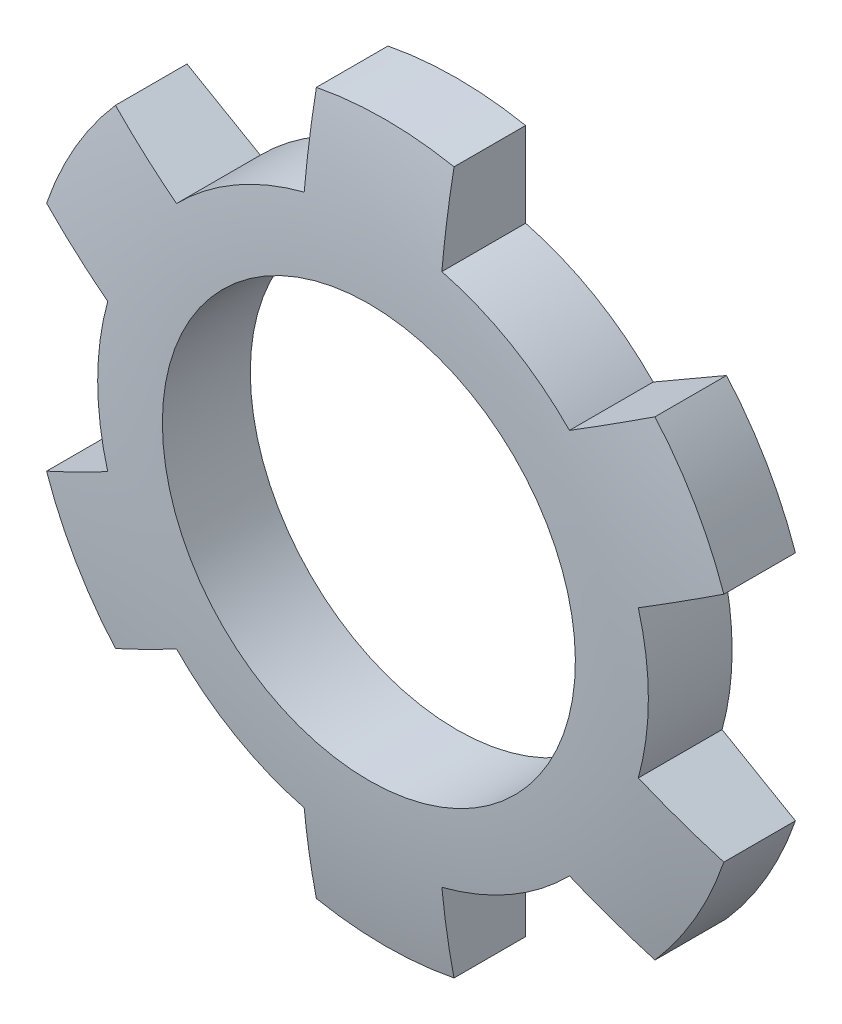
ISO-10303-21;
HEADER;
FILE_DESCRIPTION(('STEP AP214'),'2;1');
FILE_NAME('part.step','',(''),(''),'','','');
FILE_SCHEMA(('AUTOMOTIVE_DESIGN { 1 0 10303 214 1 1 1 1 }'));
ENDSEC;
DATA;
#1=APPLICATION_CONTEXT('core data for automotive mechanical design processes');
#2=APPLICATION_PROTOCOL_DEFINITION('international standard','automotive_design',2000,#1);
#3=PRODUCT_CONTEXT('',#1,'mechanical');
#4=PRODUCT('Part','Part','',(#3));
#5=PRODUCT_RELATED_PRODUCT_CATEGORY('part','',(#4));
#6=PRODUCT_DEFINITION_FORMATION('','',#4);
#7=PRODUCT_DEFINITION_CONTEXT('part definition',#1,'design');
#8=PRODUCT_DEFINITION('design','',#6,#7);
#9=PRODUCT_DEFINITION_SHAPE('','',#8);
#10=(LENGTH_UNIT() NAMED_UNIT(*) SI_UNIT(.MILLI.,.METRE.));
#11=(NAMED_UNIT(*) PLANE_ANGLE_UNIT() SI_UNIT($,.RADIAN.));
#12=(NAMED_UNIT(*) SI_UNIT($,.STERADIAN.) SOLID_ANGLE_UNIT());
#13=UNCERTAINTY_MEASURE_WITH_UNIT(LENGTH_MEASURE(1.E-05),#10,'distance_accuracy_value','');
#14=(GEOMETRIC_REPRESENTATION_CONTEXT(3) GLOBAL_UNCERTAINTY_ASSIGNED_CONTEXT((#13)) GLOBAL_UNIT_ASSIGNED_CONTEXT((#10,
#11,#12)) REPRESENTATION_CONTEXT('',''));
#15=CARTESIAN_POINT('',(0.,0.,0.));
#16=DIRECTION('',(0.,0.,1.));
#17=DIRECTION('',(1.,0.,0.));
#18=AXIS2_PLACEMENT_3D('',#15,#16,#17);
#19=CARTESIAN_POINT('',(0.,0.,4.06400000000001));
#20=DIRECTION('',(0.,0.,-1.));
#21=DIRECTION('',(-1.,0.,0.));
#22=AXIS2_PLACEMENT_3D('',#19,#20,#21);
#23=CYLINDRICAL_SURFACE('',#22,12.7);
#24=CARTESIAN_POINT('',(0.,0.,3.86412810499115));
#25=DIRECTION('',(0.,0.,-1.));
#26=DIRECTION('',(-1.,0.,0.));
#27=AXIS2_PLACEMENT_3D('',#24,#25,#26);
#28=CIRCLE('',#27,12.7);
#29=CARTESIAN_POINT('',(-3.17499999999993,12.2967221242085,3.86412810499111));
#30=VERTEX_POINT('',#29);
#31=CARTESIAN_POINT('',(-9.06177374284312,8.89799171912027,3.86412810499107));
#32=VERTEX_POINT('',#31);
#33=EDGE_CURVE('E519',#30,#32,#28,.F.);
#34=ORIENTED_EDGE('',*,*,#33,.F.);
#35=DIRECTION('',(0.,0.,-1.));
#36=VECTOR('',#35,1.);
#37=CARTESIAN_POINT('',(-3.17500000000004,12.2967221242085,11.6846437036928));
#38=LINE('',#37,#36);
#39=CARTESIAN_POINT('',(-3.17499999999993,12.2967221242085,0.));
#40=VERTEX_POINT('',#39);
#41=EDGE_CURVE('E243',#30,#40,#38,.T.);
#42=ORIENTED_EDGE('',*,*,#41,.T.);
#43=CARTESIAN_POINT('',(0.,0.,0.));
#44=DIRECTION('',(0.,0.,1.));
#45=DIRECTION('',(1.,0.,0.));
#46=AXIS2_PLACEMENT_3D('',#43,#44,#45);
#47=CIRCLE('',#46,12.7);
#48=CARTESIAN_POINT('',(-9.06177374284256,8.89799171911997,0.));
#49=VERTEX_POINT('',#48);
#50=EDGE_CURVE('E38',#40,#49,#47,.T.);
#51=ORIENTED_EDGE('',*,*,#50,.T.);
#52=DIRECTION('',(0.,0.,-1.));
#53=VECTOR('',#52,1.);
#54=CARTESIAN_POINT('',(-9.06177374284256,8.89799171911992,13.9898696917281));
#55=LINE('',#54,#53);
#56=EDGE_CURVE('E52',#32,#49,#55,.T.);
#57=ORIENTED_EDGE('',*,*,#56,.F.);
#58=EDGE_LOOP('',(#34,#42,#51,#57));
#59=FACE_BOUND('',#58,.T.);
#60=ADVANCED_FACE('F26',(#59),#23,.T.);
#61=CARTESIAN_POINT('',(0.,0.,3.86412810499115));
#62=DIRECTION('',(0.,0.,-1.));
#63=DIRECTION('',(-1.,0.,0.));
#64=AXIS2_PLACEMENT_3D('',#61,#62,#63);
#65=CIRCLE('',#64,12.7);
#66=CARTESIAN_POINT('',(-12.2367737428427,3.39873040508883,3.86412810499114));
#67=VERTEX_POINT('',#66);
#68=CARTESIAN_POINT('',(-12.2367737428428,-3.39873040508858,3.86412810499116));
#69=VERTEX_POINT('',#68);
#70=EDGE_CURVE('E209',#67,#69,#65,.F.);
#71=ORIENTED_EDGE('',*,*,#70,.F.);
#72=DIRECTION('',(0.,0.,-1.));
#73=VECTOR('',#72,1.);
#74=CARTESIAN_POINT('',(-12.2367737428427,3.39873040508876,13.9898696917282));
#75=LINE('',#74,#73);
#76=CARTESIAN_POINT('',(-12.2367737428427,3.39873040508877,0.));
#77=VERTEX_POINT('',#76);
#78=EDGE_CURVE('E495',#67,#77,#75,.T.);
#79=ORIENTED_EDGE('',*,*,#78,.T.);
#80=CARTESIAN_POINT('',(-12.2367737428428,-3.39873040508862,0.));
#81=VERTEX_POINT('',#80);
#82=EDGE_CURVE('E249',#77,#81,#47,.T.);
#83=ORIENTED_EDGE('',*,*,#82,.T.);
#84=DIRECTION('',(0.,0.,-1.));
#85=VECTOR('',#84,1.);
#86=CARTESIAN_POINT('',(-12.2367737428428,-3.39873040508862,13.9898696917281));
#87=LINE('',#86,#85);
#88=EDGE_CURVE('E481',#69,#81,#87,.T.);
#89=ORIENTED_EDGE('',*,*,#88,.F.);
#90=EDGE_LOOP('',(#71,#79,#83,#89));
#91=FACE_BOUND('',#90,.T.);
#92=ADVANCED_FACE('F440',(#91),#23,.T.);
#93=CARTESIAN_POINT('',(0.,0.,3.86412810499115));
#94=DIRECTION('',(0.,0.,-1.));
#95=DIRECTION('',(-1.,0.,0.));
#96=AXIS2_PLACEMENT_3D('',#93,#94,#95);
#97=CIRCLE('',#96,12.7);
#98=CARTESIAN_POINT('',(-9.06177374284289,-8.89799171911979,3.86412810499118));
#99=VERTEX_POINT('',#98);
#100=CARTESIAN_POINT('',(-3.17500000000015,-12.2967221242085,3.86412810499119));
#101=VERTEX_POINT('',#100);
#102=EDGE_CURVE('E521',#99,#101,#97,.F.);
#103=ORIENTED_EDGE('',*,*,#102,.F.);
#104=DIRECTION('',(0.,0.,-1.));
#105=VECTOR('',#104,1.);
#106=CARTESIAN_POINT('',(-9.06177374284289,-8.89799171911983,13.9898696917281));
#107=LINE('',#106,#105);
#108=CARTESIAN_POINT('',(-9.06177374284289,-8.89799171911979,0.));
#109=VERTEX_POINT('',#108);
#110=EDGE_CURVE('E279',#99,#109,#107,.T.);
#111=ORIENTED_EDGE('',*,*,#110,.T.);
#112=CARTESIAN_POINT('',(-3.17500000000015,-12.2967221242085,0.));
#113=VERTEX_POINT('',#112);
#114=EDGE_CURVE('E254',#109,#113,#47,.T.);
#115=ORIENTED_EDGE('',*,*,#114,.T.);
#116=DIRECTION('',(0.,0.,-1.));
#117=VECTOR('',#116,1.);
#118=CARTESIAN_POINT('',(-3.17500000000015,-12.2967221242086,11.6846437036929));
#119=LINE('',#118,#117);
#120=EDGE_CURVE('E277',#101,#113,#119,.T.);
#121=ORIENTED_EDGE('',*,*,#120,.F.);
#122=EDGE_LOOP('',(#103,#111,#115,#121));
#123=FACE_BOUND('',#122,.T.);
#124=ADVANCED_FACE('F276',(#123),#23,.T.);
#125=CARTESIAN_POINT('',(0.,0.,3.86412810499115));
#126=DIRECTION('',(0.,0.,-1.));
#127=DIRECTION('',(-1.,0.,0.));
#128=AXIS2_PLACEMENT_3D('',#125,#126,#127);
#129=CIRCLE('',#128,12.7);
#130=CARTESIAN_POINT('',(3.17499999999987,-12.2967221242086,3.86412810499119));
#131=VERTEX_POINT('',#130);
#132=CARTESIAN_POINT('',(9.06177374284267,-8.89799171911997,3.86412810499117));
#133=VERTEX_POINT('',#132);
#134=EDGE_CURVE('E472',#131,#133,#129,.F.);
#135=ORIENTED_EDGE('',*,*,#134,.F.);
#136=DIRECTION('',(0.,0.,-1.));
#137=VECTOR('',#136,1.);
#138=CARTESIAN_POINT('',(3.17499999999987,-12.2967221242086,11.6846437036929));
#139=LINE('',#138,#137);
#140=CARTESIAN_POINT('',(3.17499999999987,-12.2967221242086,0.));
#141=VERTEX_POINT('',#140);
#142=EDGE_CURVE('E296',#131,#141,#139,.T.);
#143=ORIENTED_EDGE('',*,*,#142,.T.);
#144=CARTESIAN_POINT('',(9.06177374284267,-8.89799171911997,0.));
#145=VERTEX_POINT('',#144);
#146=EDGE_CURVE('E262',#141,#145,#47,.T.);
#147=ORIENTED_EDGE('',*,*,#146,.T.);
#148=DIRECTION('',(0.,0.,-1.));
#149=VECTOR('',#148,1.);
#150=CARTESIAN_POINT('',(9.06177374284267,-8.89799171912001,13.9898696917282));
#151=LINE('',#150,#149);
#152=EDGE_CURVE('E316',#133,#145,#151,.T.);
#153=ORIENTED_EDGE('',*,*,#152,.F.);
#154=EDGE_LOOP('',(#135,#143,#147,#153));
#155=FACE_BOUND('',#154,.T.);
#156=ADVANCED_FACE('F453',(#155),#23,.T.);
#157=CARTESIAN_POINT('',(0.,0.,3.86412810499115));
#158=DIRECTION('',(0.,0.,-1.));
#159=DIRECTION('',(-1.,0.,0.));
#160=AXIS2_PLACEMENT_3D('',#157,#158,#159);
#161=CIRCLE('',#160,12.7);
#162=CARTESIAN_POINT('',(12.2367737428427,-3.39873040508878,3.86412810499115));
#163=VERTEX_POINT('',#162);
#164=CARTESIAN_POINT('',(12.2367737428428,3.3987304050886,3.86412810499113));
#165=VERTEX_POINT('',#164);
#166=EDGE_CURVE('E196',#163,#165,#161,.F.);
#167=ORIENTED_EDGE('',*,*,#166,.F.);
#168=DIRECTION('',(0.,0.,-1.));
#169=VECTOR('',#168,1.);
#170=CARTESIAN_POINT('',(12.2367737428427,-3.39873040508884,13.9898696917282));
#171=LINE('',#170,#169);
#172=CARTESIAN_POINT('',(12.2367737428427,-3.39873040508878,0.));
#173=VERTEX_POINT('',#172);
#174=EDGE_CURVE('E318',#163,#173,#171,.T.);
#175=ORIENTED_EDGE('',*,*,#174,.T.);
#176=CARTESIAN_POINT('',(12.2367737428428,3.3987304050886,0.));
#177=VERTEX_POINT('',#176);
#178=EDGE_CURVE('E256',#173,#177,#47,.T.);
#179=ORIENTED_EDGE('',*,*,#178,.T.);
#180=DIRECTION('',(0.,0.,-1.));
#181=VECTOR('',#180,1.);
#182=CARTESIAN_POINT('',(12.2367737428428,3.39873040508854,13.9898696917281));
#183=LINE('',#182,#181);
#184=EDGE_CURVE('E220',#165,#177,#183,.T.);
#185=ORIENTED_EDGE('',*,*,#184,.F.);
#186=EDGE_LOOP('',(#167,#175,#179,#185));
#187=FACE_BOUND('',#186,.T.);
#188=ADVANCED_FACE('F447',(#187),#23,.T.);
#189=CARTESIAN_POINT('',(0.,0.,3.86412810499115));
#190=DIRECTION('',(0.,0.,-1.));
#191=DIRECTION('',(-1.,0.,0.));
#192=AXIS2_PLACEMENT_3D('',#189,#190,#191);
#193=CIRCLE('',#192,12.7);
#194=CARTESIAN_POINT('',(9.06177374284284,8.89799171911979,3.86412810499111));
#195=VERTEX_POINT('',#194);
#196=CARTESIAN_POINT('',(3.17500000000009,12.2967221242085,3.86412810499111));
#197=VERTEX_POINT('',#196);
#198=EDGE_CURVE('E336',#195,#197,#193,.F.);
#199=ORIENTED_EDGE('',*,*,#198,.F.);
#200=DIRECTION('',(0.,0.,-1.));
#201=VECTOR('',#200,1.);
#202=CARTESIAN_POINT('',(9.06177374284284,8.89799171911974,13.9898696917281));
#203=LINE('',#202,#201);
#204=CARTESIAN_POINT('',(9.06177374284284,8.8979917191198,0.));
#205=VERTEX_POINT('',#204);
#206=EDGE_CURVE('E226',#195,#205,#203,.T.);
#207=ORIENTED_EDGE('',*,*,#206,.T.);
#208=CARTESIAN_POINT('',(3.17500000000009,12.2967221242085,0.));
#209=VERTEX_POINT('',#208);
#210=EDGE_CURVE('E248',#205,#209,#47,.T.);
#211=ORIENTED_EDGE('',*,*,#210,.T.);
#212=DIRECTION('',(0.,0.,-1.));
#213=VECTOR('',#212,1.);
#214=CARTESIAN_POINT('',(3.17500000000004,12.2967221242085,11.6846437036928));
#215=LINE('',#214,#213);
#216=EDGE_CURVE('E241',#197,#209,#215,.T.);
#217=ORIENTED_EDGE('',*,*,#216,.F.);
#218=EDGE_LOOP('',(#199,#207,#211,#217));
#219=FACE_BOUND('',#218,.T.);
#220=ADVANCED_FACE('F335',(#219),#23,.T.);
#221=CARTESIAN_POINT('',(0.,0.,4.06400000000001));
#222=DIRECTION('',(0.,0.,-1.));
#223=DIRECTION('',(-1.,0.,0.));
#224=AXIS2_PLACEMENT_3D('',#221,#222,#223);
#225=CYLINDRICAL_SURFACE('',#224,9.525);
#226=CARTESIAN_POINT('',(0.,0.,0.));
#227=DIRECTION('',(0.,0.,1.));
#228=DIRECTION('',(1.,0.,0.));
#229=AXIS2_PLACEMENT_3D('',#226,#227,#228);
#230=CIRCLE('',#229,9.525);
#231=CARTESIAN_POINT('',(9.525,0.,0.));
#232=VERTEX_POINT('',#231);
#233=EDGE_CURVE('E232',#232,#232,#230,.T.);
#234=ORIENTED_EDGE('',*,*,#233,.F.);
#235=EDGE_LOOP('',(#234));
#236=FACE_BOUND('',#235,.T.);
#237=CARTESIAN_POINT('',(0.,0.,4.05553386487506));
#238=DIRECTION('',(0.,0.,-1.));
#239=DIRECTION('',(-1.,0.,0.));
#240=AXIS2_PLACEMENT_3D('',#237,#238,#239);
#241=CIRCLE('',#240,9.525);
#242=CARTESIAN_POINT('',(-9.525,0.,4.05553386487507));
#243=VERTEX_POINT('',#242);
#244=EDGE_CURVE('E338',#243,#243,#241,.F.);
#245=ORIENTED_EDGE('',*,*,#244,.T.);
#246=EDGE_LOOP('',(#245));
#247=FACE_BOUND('',#246,.T.);
#248=ADVANCED_FACE('F437',(#236,#247),#225,.F.);
#249=CARTESIAN_POINT('',(3.17499999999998,16.2018355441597,11.6846437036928));
#250=DIRECTION('',(-1.,0.,0.));
#251=DIRECTION('',(0.,0.,1.));
#252=AXIS2_PLACEMENT_3D('',#249,#250,#251);
#253=PLANE('',#252);
#254=CARTESIAN_POINT('',(3.17499999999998,14.2418245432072,3.63105388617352));
#255=CARTESIAN_POINT('',(3.17499999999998,14.8151415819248,3.54877934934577));
#256=CARTESIAN_POINT('',(3.17499999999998,15.386756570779,3.45460977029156));
#257=CARTESIAN_POINT('',(3.17499999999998,16.525563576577,3.24245836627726));
#258=CARTESIAN_POINT('',(3.17499999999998,17.0927552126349,3.12447451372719));
#259=CARTESIAN_POINT('',(3.17499999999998,18.7856742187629,2.73498785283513));
#260=CARTESIAN_POINT('',(3.17499999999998,19.9034348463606,2.4278513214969));
#261=CARTESIAN_POINT('',(3.17499999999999,22.1178172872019,1.71735498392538));
#262=CARTESIAN_POINT('',(3.175,23.2141938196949,1.31323424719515));
#263=CARTESIAN_POINT('',(3.17499999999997,25.3686109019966,0.412658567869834));
#264=CARTESIAN_POINT('',(3.17499999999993,26.4266450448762,-0.0838117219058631));
#265=CARTESIAN_POINT('',(3.17499999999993,28.4943270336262,-1.16454103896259));
#266=CARTESIAN_POINT('',(3.17499999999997,29.5040625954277,-1.74863228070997));
#267=CARTESIAN_POINT('',(3.175,31.4697708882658,-3.00107648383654));
#268=CARTESIAN_POINT('',(3.17499999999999,32.425746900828,-3.6694242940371));
#269=CARTESIAN_POINT('',(3.17499999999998,34.2738300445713,-5.08319064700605));
#270=CARTESIAN_POINT('',(3.17499999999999,35.1661400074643,-5.82834407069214));
#271=CARTESIAN_POINT('',(3.17499999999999,36.8838510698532,-7.39216703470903));
#272=CARTESIAN_POINT('',(3.17499999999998,37.7092516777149,-8.21083711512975));
#273=CARTESIAN_POINT('',(3.17499999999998,39.2762817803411,-9.9040650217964));
#274=CARTESIAN_POINT('',(3.17499999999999,40.0189015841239,-10.7777066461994));
#275=CARTESIAN_POINT('',(3.17499999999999,41.4278248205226,-12.5844861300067));
#276=CARTESIAN_POINT('',(3.17499999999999,42.0941293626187,-13.5176231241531));
#277=CARTESIAN_POINT('',(3.17499999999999,43.3463521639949,-15.437814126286));
#278=CARTESIAN_POINT('',(3.17499999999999,43.9321818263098,-16.4249259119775));
#279=CARTESIAN_POINT('',(3.17499999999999,45.0184002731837,-18.4450957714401));
#280=CARTESIAN_POINT('',(3.17499999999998,45.5187887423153,-19.4781540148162));
#281=CARTESIAN_POINT('',(3.17499999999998,46.4296532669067,-21.5807955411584));
#282=CARTESIAN_POINT('',(3.17499999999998,46.8403017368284,-22.6503041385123));
#283=CARTESIAN_POINT('',(3.17499999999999,47.5699851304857,-24.8201272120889));
#284=CARTESIAN_POINT('',(3.17499999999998,47.8890203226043,-25.9204415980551));
#285=CARTESIAN_POINT('',(3.17499999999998,48.4330959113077,-28.1436138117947));
#286=CARTESIAN_POINT('',(3.17499999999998,48.6581728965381,-29.26646268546));
#287=CARTESIAN_POINT('',(3.17499999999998,49.0129069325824,-31.5271337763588));
#288=CARTESIAN_POINT('',(3.17499999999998,49.1425639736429,-32.6649559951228));
#289=CARTESIAN_POINT('',(3.17499999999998,49.3054992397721,-34.9469971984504));
#290=CARTESIAN_POINT('',(3.17499999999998,49.3388181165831,-36.0912132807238));
#291=CARTESIAN_POINT('',(3.17499999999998,49.3089555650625,-38.3783850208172));
#292=CARTESIAN_POINT('',(3.17499999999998,49.2457741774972,-39.5213406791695));
#293=CARTESIAN_POINT('',(3.17499999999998,49.0233208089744,-41.798280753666));
#294=CARTESIAN_POINT('',(3.17499999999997,48.8640140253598,-42.932261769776));
#295=CARTESIAN_POINT('',(3.17499999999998,48.4504159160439,-45.1827689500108));
#296=CARTESIAN_POINT('',(3.17499999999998,48.1961244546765,-46.2992950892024));
#297=CARTESIAN_POINT('',(3.17499999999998,47.5942916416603,-48.5072373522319));
#298=CARTESIAN_POINT('',(3.17499999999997,47.2467261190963,-49.5986468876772));
#299=CARTESIAN_POINT('',(3.17499999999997,46.460854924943,-51.7482892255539));
#300=CARTESIAN_POINT('',(3.17499999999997,46.0225495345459,-52.8065221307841));
#301=CARTESIAN_POINT('',(3.17499999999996,45.0588155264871,-54.8812321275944));
#302=CARTESIAN_POINT('',(3.17499999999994,44.5334760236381,-55.8977506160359));
#303=CARTESIAN_POINT('',(3.17499999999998,43.3990958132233,-57.882969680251));
#304=CARTESIAN_POINT('',(3.17500000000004,42.790054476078,-58.8516698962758));
#305=CARTESIAN_POINT('',(3.17500000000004,41.4931426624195,-60.7336034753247));
#306=CARTESIAN_POINT('',(3.17499999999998,40.8053373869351,-61.6468817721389));
#307=CARTESIAN_POINT('',(3.17499999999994,39.3554048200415,-63.4123536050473));
#308=CARTESIAN_POINT('',(3.17499999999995,38.593279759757,-64.2645489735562));
#309=CARTESIAN_POINT('',(3.17499999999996,36.9976514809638,-65.9043940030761));
#310=CARTESIAN_POINT('',(3.17499999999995,36.1639358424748,-66.6918369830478));
#311=CARTESIAN_POINT('',(3.17499999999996,34.4330261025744,-68.1937439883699));
#312=CARTESIAN_POINT('',(3.17499999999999,33.535825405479,-68.9082004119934));
#313=CARTESIAN_POINT('',(3.17499999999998,31.681354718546,-70.2612559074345));
#314=CARTESIAN_POINT('',(3.17499999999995,30.7238946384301,-70.8995944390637));
#315=CARTESIAN_POINT('',(3.17499999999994,28.7587775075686,-72.0929743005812));
#316=CARTESIAN_POINT('',(3.17499999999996,27.75113540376,-72.648040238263));
#317=CARTESIAN_POINT('',(3.17499999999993,25.701172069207,-73.6670297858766));
#318=CARTESIAN_POINT('',(3.17499999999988,24.659204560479,-74.1316660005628));
#319=CARTESIAN_POINT('',(3.175,22.5391788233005,-74.9727427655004));
#320=CARTESIAN_POINT('',(3.17500000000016,21.4610934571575,-75.3491152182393));
#321=CARTESIAN_POINT('',(3.17500000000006,19.8231820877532,-75.845498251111));
#322=CARTESIAN_POINT('',(3.17499999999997,19.2734771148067,-75.9996546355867));
#323=CARTESIAN_POINT('',(3.1749999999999,18.1680994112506,-76.2850193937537));
#324=CARTESIAN_POINT('',(3.17499999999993,17.6124266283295,-76.4162275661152));
#325=CARTESIAN_POINT('',(3.17499999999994,16.4970809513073,-76.6553434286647));
#326=CARTESIAN_POINT('',(3.17499999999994,15.9374163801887,-76.7632900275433));
#327=CARTESIAN_POINT('',(3.17499999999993,14.8141455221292,-76.956123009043));
#328=CARTESIAN_POINT('',(3.17499999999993,14.2505393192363,-77.0410098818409));
#329=CARTESIAN_POINT('',(3.17499999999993,13.1129559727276,-77.1887531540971));
#330=CARTESIAN_POINT('',(3.17499999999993,12.5389394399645,-77.2513077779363));
#331=CARTESIAN_POINT('',(3.17499999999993,11.6763964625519,-77.3276374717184));
#332=CARTESIAN_POINT('',(3.17499999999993,11.3886169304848,-77.3501642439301));
#333=CARTESIAN_POINT('',(3.17499999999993,10.8126647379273,-77.389444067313));
#334=CARTESIAN_POINT('',(3.17499999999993,10.5244920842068,-77.4061972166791));
#335=CARTESIAN_POINT('',(3.17499999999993,9.94745169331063,-77.434029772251));
#336=CARTESIAN_POINT('',(3.17499999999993,9.65858355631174,-77.4451008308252));
#337=CARTESIAN_POINT('',(3.17499999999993,9.08067210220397,-77.4616468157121));
#338=CARTESIAN_POINT('',(3.17499999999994,8.79162877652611,-77.4671214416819));
#339=CARTESIAN_POINT('',(3.17499999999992,8.21345079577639,-77.4726341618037));
#340=CARTESIAN_POINT('',(3.1749999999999,7.92431613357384,-77.4726714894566));
#341=CARTESIAN_POINT('',(3.17499999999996,7.34614430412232,-77.4675370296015));
#342=CARTESIAN_POINT('',(3.17500000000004,7.05710712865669,-77.4623661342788));
#343=CARTESIAN_POINT('',(3.17500000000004,6.46679878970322,-77.4468211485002));
#344=CARTESIAN_POINT('',(3.17499999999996,6.16553332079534,-77.4362338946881));
#345=CARTESIAN_POINT('',(3.1749999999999,5.56320596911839,-77.4103153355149));
#346=CARTESIAN_POINT('',(3.17499999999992,5.26214408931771,-77.3949839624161));
#347=CARTESIAN_POINT('',(3.17499999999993,4.66003534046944,-77.3604316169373));
#348=CARTESIAN_POINT('',(3.17499999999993,4.35898863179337,-77.3412079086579));
#349=CARTESIAN_POINT('',(3.17499999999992,3.75706414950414,-77.3002532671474));
#350=CARTESIAN_POINT('',(3.17499999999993,3.4561863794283,-77.2785222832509));
#351=CARTESIAN_POINT('',(3.17499999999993,2.85483239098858,-77.2347718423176));
#352=CARTESIAN_POINT('',(3.17499999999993,2.5543561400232,-77.2127527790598));
#353=CARTESIAN_POINT('',(3.17499999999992,1.95317041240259,-77.1717898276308));
#354=CARTESIAN_POINT('',(3.17499999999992,1.65246093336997,-77.1528459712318));
#355=CARTESIAN_POINT('',(3.17499999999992,1.20130279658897,-77.1300796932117));
#356=CARTESIAN_POINT('',(3.17499999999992,1.05100132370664,-77.123435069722));
#357=CARTESIAN_POINT('',(3.17499999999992,0.750312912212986,-77.11255102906));
#358=CARTESIAN_POINT('',(3.17499999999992,0.599925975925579,-77.1083115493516));
#359=CARTESIAN_POINT('',(3.17499999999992,0.299119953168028,-77.1026198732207));
#360=CARTESIAN_POINT('',(3.17499999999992,0.148700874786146,-77.1011672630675));
#361=CARTESIAN_POINT('',(3.17499999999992,-0.152137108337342,-77.1011893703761));
#362=CARTESIAN_POINT('',(3.17499999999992,-0.30255601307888,-77.1026640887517));
#363=CARTESIAN_POINT('',(3.17499999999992,-0.603133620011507,-77.1083935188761));
#364=CARTESIAN_POINT('',(3.17499999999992,-0.753292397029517,-77.1126444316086));
#365=CARTESIAN_POINT('',(3.17499999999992,-1.0535246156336,-77.123541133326));
#366=CARTESIAN_POINT('',(3.17499999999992,-1.20359805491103,-77.1301869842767));
#367=CARTESIAN_POINT('',(3.17499999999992,-1.65372966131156,-77.1529273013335));
#368=CARTESIAN_POINT('',(3.17499999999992,-1.9536415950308,-77.1718230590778));
#369=CARTESIAN_POINT('',(3.17499999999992,-2.55366213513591,-77.2127043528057));
#370=CARTESIAN_POINT('',(3.17499999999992,-2.85377041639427,-77.2346942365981));
#371=CARTESIAN_POINT('',(3.17499999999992,-3.45398204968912,-77.2783622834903));
#372=CARTESIAN_POINT('',(3.17499999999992,-3.7540853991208,-77.3000404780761));
#373=CARTESIAN_POINT('',(3.17499999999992,-4.35494004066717,-77.3409424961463));
#374=CARTESIAN_POINT('',(3.17499999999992,-4.65569160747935,-77.3601623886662));
#375=CARTESIAN_POINT('',(3.17499999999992,-5.25742871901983,-77.3947330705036));
#376=CARTESIAN_POINT('',(3.17499999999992,-5.5584142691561,-77.4100837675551));
#377=CARTESIAN_POINT('',(3.17499999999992,-6.16045043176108,-77.4360401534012));
#378=CARTESIAN_POINT('',(3.17499999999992,-6.46150094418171,-77.4466481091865));
#379=CARTESIAN_POINT('',(3.17499999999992,-7.06373813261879,-77.4625737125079));
#380=CARTESIAN_POINT('',(3.17499999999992,-7.36492480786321,-77.4678913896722));
#381=CARTESIAN_POINT('',(3.17499999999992,-8.25832382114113,-77.4752393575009));
#382=CARTESIAN_POINT('',(3.17499999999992,-8.85063130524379,-77.4691326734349));
#383=CARTESIAN_POINT('',(3.17499999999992,-10.0346160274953,-77.4333159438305));
#384=CARTESIAN_POINT('',(3.17499999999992,-10.6262931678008,-77.4036026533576));
#385=CARTESIAN_POINT('',(3.17499999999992,-11.8085571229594,-77.3197579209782));
#386=CARTESIAN_POINT('',(3.17499999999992,-12.3991421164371,-77.2656006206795));
#387=CARTESIAN_POINT('',(3.17499999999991,-13.577494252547,-77.1324781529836));
#388=CARTESIAN_POINT('',(3.17499999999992,-14.1652614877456,-77.0535138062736));
#389=CARTESIAN_POINT('',(3.17499999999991,-15.3336795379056,-76.8711368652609));
#390=CARTESIAN_POINT('',(3.17499999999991,-15.9143517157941,-76.7678612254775));
#391=CARTESIAN_POINT('',(3.17499999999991,-17.07078418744,-76.5366354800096));
#392=CARTESIAN_POINT('',(3.17499999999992,-17.6465443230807,-76.408684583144));
#393=CARTESIAN_POINT('',(3.17499999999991,-18.791505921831,-76.1283595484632));
#394=CARTESIAN_POINT('',(3.17499999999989,-19.3607131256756,-75.9760088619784));
#395=CARTESIAN_POINT('',(3.17499999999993,-20.4920565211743,-75.6469961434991));
#396=CARTESIAN_POINT('',(3.17499999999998,-21.0541927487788,-75.4703342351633));
#397=CARTESIAN_POINT('',(3.17499999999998,-22.1533533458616,-75.0987102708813));
#398=CARTESIAN_POINT('',(3.17499999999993,-22.690621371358,-74.9044685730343));
#399=CARTESIAN_POINT('',(3.17499999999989,-23.7565442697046,-74.4936934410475));
#400=CARTESIAN_POINT('',(3.1749999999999,-24.2851994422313,-74.2771607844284));
#401=CARTESIAN_POINT('',(3.17499999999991,-25.3338545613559,-73.8217651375));
#402=CARTESIAN_POINT('',(3.17499999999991,-25.8538387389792,-73.5828657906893));
#403=CARTESIAN_POINT('',(3.17499999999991,-26.8832862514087,-73.0834674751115));
#404=CARTESIAN_POINT('',(3.17499999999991,-27.3927495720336,-72.8229684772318));
#405=CARTESIAN_POINT('',(3.1749999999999,-28.9086667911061,-72.0071908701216));
#406=CARTESIAN_POINT('',(3.17499999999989,-29.8980110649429,-71.4196444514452));
#407=CARTESIAN_POINT('',(3.17499999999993,-31.8227338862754,-70.1636178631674));
#408=CARTESIAN_POINT('',(3.17499999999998,-32.758149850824,-69.4951948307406));
#409=CARTESIAN_POINT('',(3.17499999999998,-34.5678592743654,-68.0827848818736));
#410=CARTESIAN_POINT('',(3.17499999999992,-35.4422429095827,-67.3389136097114));
#411=CARTESIAN_POINT('',(3.17499999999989,-37.1253377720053,-65.7798595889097));
#412=CARTESIAN_POINT('',(3.17499999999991,-37.9340323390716,-64.964658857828));
#413=CARTESIAN_POINT('',(3.1749999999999,-39.4786408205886,-63.2700775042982));
#414=CARTESIAN_POINT('',(3.17499999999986,-40.2146545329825,-62.3907878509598));
#415=CARTESIAN_POINT('',(3.17499999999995,-41.6098548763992,-60.5733529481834));
#416=CARTESIAN_POINT('',(3.17500000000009,-42.2690480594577,-59.6352127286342));
#417=CARTESIAN_POINT('',(3.17500000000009,-43.5055405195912,-57.7073499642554));
#418=CARTESIAN_POINT('',(3.17499999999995,-44.0828961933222,-56.7176635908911));
#419=CARTESIAN_POINT('',(3.17499999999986,-45.1521485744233,-54.6931216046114));
#420=CARTESIAN_POINT('',(3.1749999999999,-45.6440430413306,-53.6582648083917));
#421=CARTESIAN_POINT('',(3.17499999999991,-46.5389786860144,-51.5504499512));
#422=CARTESIAN_POINT('',(3.17499999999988,-46.9419929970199,-50.4774804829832));
#423=CARTESIAN_POINT('',(3.17499999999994,-47.6560983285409,-48.3013854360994));
#424=CARTESIAN_POINT('',(3.17500000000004,-47.9671900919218,-47.1982601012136));
#425=CARTESIAN_POINT('',(3.17500000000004,-48.4950028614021,-44.9706751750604));
#426=CARTESIAN_POINT('',(3.17499999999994,-48.7118058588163,-43.8462350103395));
#427=CARTESIAN_POINT('',(3.17499999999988,-49.0498901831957,-41.5830829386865));
#428=CARTESIAN_POINT('',(3.17499999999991,-49.1711713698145,-40.4443710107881));
#429=CARTESIAN_POINT('',(3.17499999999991,-49.3173368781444,-38.1609329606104));
#430=CARTESIAN_POINT('',(3.17499999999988,-49.342234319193,-37.0162076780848));
#431=CARTESIAN_POINT('',(3.17499999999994,-49.2954911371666,-34.7287305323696));
#432=CARTESIAN_POINT('',(3.17500000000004,-49.2238505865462,-33.5859786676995));
#433=CARTESIAN_POINT('',(3.17500000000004,-48.9845775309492,-31.3109106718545));
#434=CARTESIAN_POINT('',(3.17499999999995,-48.8169733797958,-30.1785915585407));
#435=CARTESIAN_POINT('',(3.17499999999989,-48.3869883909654,-27.9320940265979));
#436=CARTESIAN_POINT('',(3.17499999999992,-48.1246075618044,-26.817915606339));
#437=CARTESIAN_POINT('',(3.17499999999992,-47.5068444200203,-24.615282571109));
#438=CARTESIAN_POINT('',(3.17499999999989,-47.1514339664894,-23.5268358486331));
#439=CARTESIAN_POINT('',(3.17499999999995,-46.3501816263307,-21.3837518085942));
#440=CARTESIAN_POINT('',(3.17500000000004,-45.904339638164,-20.3291145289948));
#441=CARTESIAN_POINT('',(3.17500000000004,-44.9251925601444,-18.2607019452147));
#442=CARTESIAN_POINT('',(3.17499999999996,-44.3918501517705,-17.2469443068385));
#443=CARTESIAN_POINT('',(3.1749999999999,-43.2416425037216,-15.2679765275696));
#444=CARTESIAN_POINT('',(3.17499999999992,-42.6247774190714,-14.3027662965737));
#445=CARTESIAN_POINT('',(3.17499999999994,-41.3125923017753,-12.4287008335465));
#446=CARTESIAN_POINT('',(3.17499999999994,-40.6173526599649,-11.5197893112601));
#447=CARTESIAN_POINT('',(3.17499999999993,-39.1528580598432,-9.76368637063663));
#448=CARTESIAN_POINT('',(3.17499999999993,-38.3836028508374,-8.91649516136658));
#449=CARTESIAN_POINT('',(3.17499999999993,-36.7770060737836,-7.29028006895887));
#450=CARTESIAN_POINT('',(3.17499999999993,-35.9397028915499,-6.51121826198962));
#451=CARTESIAN_POINT('',(3.17499999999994,-34.2026043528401,-5.02622555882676));
#452=CARTESIAN_POINT('',(3.17499999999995,-33.3028099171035,-4.32029358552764));
#453=CARTESIAN_POINT('',(3.17499999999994,-31.4443225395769,-2.98448688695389));
#454=CARTESIAN_POINT('',(3.17499999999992,-30.4854607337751,-2.35484708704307));
#455=CARTESIAN_POINT('',(3.17499999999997,-28.5181052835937,-1.17847298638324));
#456=CARTESIAN_POINT('',(3.17500000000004,-27.5096091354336,-0.631742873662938));
#457=CARTESIAN_POINT('',(3.17500000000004,-25.4464743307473,0.376850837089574));
#458=CARTESIAN_POINT('',(3.17499999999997,-24.3916810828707,0.838398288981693));
#459=CARTESIAN_POINT('',(3.17499999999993,-22.2471641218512,1.67101803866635));
#460=CARTESIAN_POINT('',(3.17499999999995,-21.1574445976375,2.04210114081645));
#461=CARTESIAN_POINT('',(3.17499999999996,-18.9586225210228,2.68925506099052));
#462=CARTESIAN_POINT('',(3.17499999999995,-17.8497183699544,2.96599673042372));
#463=CARTESIAN_POINT('',(3.17499999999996,-16.1722393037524,3.3116966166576));
#464=CARTESIAN_POINT('',(3.17499999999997,-15.6105984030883,3.41537658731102));
#465=CARTESIAN_POINT('',(3.17499999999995,-14.4835463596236,3.59959000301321));
#466=CARTESIAN_POINT('',(3.17499999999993,-13.918135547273,3.68012545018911));
#467=CARTESIAN_POINT('',(3.17499999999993,-12.8021146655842,3.81600443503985));
#468=CARTESIAN_POINT('',(3.17499999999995,-12.2515897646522,3.872052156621));
#469=CARTESIAN_POINT('',(3.17499999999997,-11.1487555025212,3.96276600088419));
#470=CARTESIAN_POINT('',(3.17499999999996,-10.5964460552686,3.99743107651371));
#471=CARTESIAN_POINT('',(3.17499999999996,-9.4910209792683,4.04589279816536));
#472=CARTESIAN_POINT('',(3.17499999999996,-8.93790550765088,4.05969307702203));
#473=CARTESIAN_POINT('',(3.17499999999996,-7.83165719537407,4.06740638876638));
#474=CARTESIAN_POINT('',(3.17499999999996,-7.27852438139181,4.06132348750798));
#475=CARTESIAN_POINT('',(3.17499999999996,-6.44769599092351,4.03877611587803));
#476=CARTESIAN_POINT('',(3.17499999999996,-6.16979662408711,4.02897739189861));
#477=CARTESIAN_POINT('',(3.17499999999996,-5.61416865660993,4.00533308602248));
#478=CARTESIAN_POINT('',(3.17499999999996,-5.33644005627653,3.99148749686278));
#479=CARTESIAN_POINT('',(3.17499999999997,-4.78101201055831,3.96039511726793));
#480=CARTESIAN_POINT('',(3.17499999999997,-4.50331268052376,3.94314631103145));
#481=CARTESIAN_POINT('',(3.17499999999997,-3.94807824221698,3.90626270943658));
#482=CARTESIAN_POINT('',(3.17499999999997,-3.67054313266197,3.88662793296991));
#483=CARTESIAN_POINT('',(3.17499999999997,-3.11606645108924,3.84656616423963));
#484=CARTESIAN_POINT('',(3.17499999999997,-2.83912476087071,3.82614076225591));
#485=CARTESIAN_POINT('',(3.17499999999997,-2.2851125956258,3.78679205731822));
#486=CARTESIAN_POINT('',(3.17499999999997,-2.00804211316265,3.76786885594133));
#487=CARTESIAN_POINT('',(3.17499999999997,-1.45397092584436,3.73482148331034));
#488=CARTESIAN_POINT('',(3.17499999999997,-1.17697065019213,3.72069074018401));
#489=CARTESIAN_POINT('',(3.17499999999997,-0.761267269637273,3.7056482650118));
#490=CARTESIAN_POINT('',(3.17499999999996,-0.622677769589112,3.70165979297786));
#491=CARTESIAN_POINT('',(3.17499999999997,-0.345450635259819,3.69602581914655));
#492=CARTESIAN_POINT('',(3.17499999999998,-0.206813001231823,3.69438030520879));
#493=CARTESIAN_POINT('',(3.17499999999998,0.0812694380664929,3.69354174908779));
#494=CARTESIAN_POINT('',(3.17499999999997,0.230714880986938,3.69454972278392));
#495=CARTESIAN_POINT('',(3.17499999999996,0.529560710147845,3.69935089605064));
#496=CARTESIAN_POINT('',(3.17499999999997,0.678961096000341,3.70314411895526));
#497=CARTESIAN_POINT('',(3.17499999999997,1.12709224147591,3.7182144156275));
#498=CARTESIAN_POINT('',(3.17499999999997,1.42569563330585,3.7331820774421));
#499=CARTESIAN_POINT('',(3.17499999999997,2.02297147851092,3.76871252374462));
#500=CARTESIAN_POINT('',(3.17499999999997,2.32164339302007,3.78928346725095));
#501=CARTESIAN_POINT('',(3.17499999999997,2.91885405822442,3.83192852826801));
#502=CARTESIAN_POINT('',(3.17499999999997,3.21739281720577,3.8540025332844));
#503=CARTESIAN_POINT('',(3.17499999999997,3.81517024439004,3.89690433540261));
#504=CARTESIAN_POINT('',(3.17499999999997,4.1144091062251,3.91772951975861));
#505=CARTESIAN_POINT('',(3.17499999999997,4.71308485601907,3.95628772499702));
#506=CARTESIAN_POINT('',(3.17499999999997,5.01252173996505,3.97402080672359));
#507=CARTESIAN_POINT('',(3.17499999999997,5.61142814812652,4.005257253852));
#508=CARTESIAN_POINT('',(3.17499999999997,5.91089752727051,4.0187633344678));
#509=CARTESIAN_POINT('',(3.17499999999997,6.51001587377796,4.04084901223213));
#510=CARTESIAN_POINT('',(3.17499999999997,6.80966484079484,4.04942861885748));
#511=CARTESIAN_POINT('',(3.17499999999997,7.70511629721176,4.06696516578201));
#512=CARTESIAN_POINT('',(3.17499999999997,8.3011046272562,4.06792483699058));
#513=CARTESIAN_POINT('',(3.17499999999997,9.49280502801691,4.04631919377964));
#514=CARTESIAN_POINT('',(3.17499999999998,10.0885169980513,4.02374823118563));
#515=CARTESIAN_POINT('',(3.17499999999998,11.278737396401,3.9540975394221));
#516=CARTESIAN_POINT('',(3.17499999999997,11.8732453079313,3.90700889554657));
#517=CARTESIAN_POINT('',(3.17499999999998,13.0597113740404,3.78783162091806));
#518=CARTESIAN_POINT('',(3.17499999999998,13.6516697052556,3.71574475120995));
#519=CARTESIAN_POINT('',(3.17499999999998,14.2418245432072,3.63105388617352));
#520=B_SPLINE_CURVE_WITH_KNOTS('',3,(#254,#255,#256,#257,#258,#259,#260,#261,#262,#263,#264,
#265,#266,#267,#268,#269,#270,#271,#272,#273,#274,#275,#276,#277,#278,#279,#280,#281,#282,#283,
#284,#285,#286,#287,#288,#289,#290,#291,#292,#293,#294,#295,#296,#297,#298,#299,#300,#301,#302,
#303,#304,#305,#306,#307,#308,#309,#310,#311,#312,#313,#314,#315,#316,#317,#318,#319,#320,#321,
#322,#323,#324,#325,#326,#327,#328,#329,#330,#331,#332,#333,#334,#335,#336,#337,#338,#339,#340,
#341,#342,#343,#344,#345,#346,#347,#348,#349,#350,#351,#352,#353,#354,#355,#356,#357,#358,#359,
#360,#361,#362,#363,#364,#365,#366,#367,#368,#369,#370,#371,#372,#373,#374,#375,#376,#377,#378,
#379,#380,#381,#382,#383,#384,#385,#386,#387,#388,#389,#390,#391,#392,#393,#394,#395,#396,#397,
#398,#399,#400,#401,#402,#403,#404,#405,#406,#407,#408,#409,#410,#411,#412,#413,#414,#415,#416,
#417,#418,#419,#420,#421,#422,#423,#424,#425,#426,#427,#428,#429,#430,#431,#432,#433,#434,#435,
#436,#437,#438,#439,#440,#441,#442,#443,#444,#445,#446,#447,#448,#449,#450,#451,#452,#453,#454,
#455,#456,#457,#458,#459,#460,#461,#462,#463,#464,#465,#466,#467,#468,#469,#470,#471,#472,#473,
#474,#475,#476,#477,#478,#479,#480,#481,#482,#483,#484,#485,#486,#487,#488,#489,#490,#491,#492,
#493,#494,#495,#496,#497,#498,#499,#500,#501,#502,#503,#504,#505,#506,#507,#508,#509,#510,#511,
#512,#513,#514,#515,#516,#517,#518,#519),.UNSPECIFIED.,.T.,.F.,(4,2,2,2,2,2,2,2,2,2,2,2,2,2,2,2,
2,2,2,2,2,2,2,2,2,2,2,2,2,2,2,2,2,2,2,2,2,2,2,2,2,2,2,2,2,2,2,2,2,2,2,2,2,2,2,2,2,2,2,2,2,2,2,2,
2,2,2,2,2,2,2,2,2,2,2,2,2,2,2,2,2,2,2,2,2,2,2,2,2,2,2,2,2,2,2,2,2,2,2,2,2,2,2,2,2,2,2,2,2,2,2,2,
2,2,2,2,2,2,2,2,2,2,2,2,2,2,2,2,2,2,2,2,4),(0.,1.73743433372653,3.47501665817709,6.948099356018,
10.4493777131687,13.9512384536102,17.4464771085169,20.941502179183,24.4248432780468,
27.9082099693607,31.3439932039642,34.7797264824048,38.2192124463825,41.6587111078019,
45.0915423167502,48.5243634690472,51.9558465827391,55.3873300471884,58.8173653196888,
62.2473991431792,65.6786755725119,69.1099569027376,72.5421282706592,75.9742890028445,
79.402956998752,82.8316507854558,86.2575265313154,89.6832994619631,93.1196137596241,
96.5562855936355,100.004402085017,103.451497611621,106.870219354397,110.291570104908,
112.003900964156,113.716246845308,115.425705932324,117.135128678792,118.866846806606,
119.732778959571,120.598696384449,121.465882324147,122.333114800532,123.200469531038,
124.067675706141,124.971987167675,125.876311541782,126.781273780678,127.686254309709,
128.590105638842,129.49396630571,129.945295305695,130.396612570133,130.847862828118,
131.299113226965,131.749747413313,132.20039326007,133.101857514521,134.004601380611,
134.907253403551,135.811331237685,136.71543062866,137.619097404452,138.522759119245,
140.299300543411,142.076086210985,143.854755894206,145.633366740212,147.402188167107,
149.171066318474,150.938254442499,152.705433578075,154.418843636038,156.13219394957,
157.848379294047,159.564566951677,163.012058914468,166.457129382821,169.89699696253,
173.337734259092,176.773679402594,180.209331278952,183.642603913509,187.075966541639,
190.510365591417,193.944736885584,197.376115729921,200.807499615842,204.238416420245,
207.669330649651,211.099231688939,214.529132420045,217.960071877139,221.391015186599,
224.823425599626,228.255829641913,231.684744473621,235.11367091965,238.540676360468,
241.96763131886,245.404884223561,248.842310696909,252.292248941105,255.741774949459,
259.166233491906,260.879230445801,262.592079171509,264.251776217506,265.911554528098,
267.57104381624,269.230193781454,270.064385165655,270.898578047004,271.733266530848,
272.567948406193,273.401030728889,274.234169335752,275.066160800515,275.482083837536,
275.898004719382,276.346323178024,276.794645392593,277.691461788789,278.589591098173,
279.487653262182,280.387533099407,281.28739522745,282.186678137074,283.085959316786,
284.873466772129,286.661403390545,288.449990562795,290.238451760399),.UNSPECIFIED.);
#521=CARTESIAN_POINT('',(3.17499999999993,16.2018355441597,3.30199999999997));
#522=VERTEX_POINT('',#521);
#523=EDGE_CURVE('E333',#197,#522,#520,.T.);
#524=ORIENTED_EDGE('',*,*,#523,.F.);
#525=ORIENTED_EDGE('',*,*,#216,.T.);
#526=DIRECTION('',(0.,1.,0.));
#527=VECTOR('',#526,1.);
#528=CARTESIAN_POINT('',(3.17499999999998,16.2018355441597,0.));
#529=LINE('',#528,#527);
#530=CARTESIAN_POINT('',(3.17499999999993,16.2018355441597,0.));
#531=VERTEX_POINT('',#530);
#532=EDGE_CURVE('E238',#209,#531,#529,.T.);
#533=ORIENTED_EDGE('',*,*,#532,.T.);
#534=DIRECTION('',(0.,0.,-1.));
#535=VECTOR('',#534,1.);
#536=CARTESIAN_POINT('',(3.17499999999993,16.2018355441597,11.6846437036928));
#537=LINE('',#536,#535);
#538=EDGE_CURVE('E237',#522,#531,#537,.T.);
#539=ORIENTED_EDGE('',*,*,#538,.F.);
#540=EDGE_LOOP('',(#524,#525,#533,#539));
#541=FACE_BOUND('',#540,.T.);
#542=ADVANCED_FACE('F332',(#541),#253,.F.);
#543=CARTESIAN_POINT('',(0.,0.,11.6846437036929));
#544=DIRECTION('',(0.,0.,-1.));
#545=DIRECTION('',(-1.,0.,0.));
#546=AXIS2_PLACEMENT_3D('',#543,#544,#545);
#547=CYLINDRICAL_SURFACE('',#546,16.51);
#548=CARTESIAN_POINT('',(0.,0.,3.30200000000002));
#549=DIRECTION('',(0.,0.,1.));
#550=DIRECTION('',(1.,0.,0.));
#551=AXIS2_PLACEMENT_3D('',#548,#549,#550);
#552=CIRCLE('',#551,16.51);
#553=CARTESIAN_POINT('',(-3.17500000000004,16.2018355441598,3.30199999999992));
#554=VERTEX_POINT('',#553);
#555=EDGE_CURVE('E210',#522,#554,#552,.T.);
#556=ORIENTED_EDGE('',*,*,#555,.F.);
#557=ORIENTED_EDGE('',*,*,#538,.T.);
#558=CARTESIAN_POINT('',(0.,0.,0.));
#559=DIRECTION('',(0.,0.,1.));
#560=DIRECTION('',(1.,0.,0.));
#561=AXIS2_PLACEMENT_3D('',#558,#559,#560);
#562=CIRCLE('',#561,16.51);
#563=CARTESIAN_POINT('',(-3.17500000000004,16.2018355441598,0.));
#564=VERTEX_POINT('',#563);
#565=EDGE_CURVE('E234',#531,#564,#562,.T.);
#566=ORIENTED_EDGE('',*,*,#565,.T.);
#567=DIRECTION('',(0.,0.,-1.));
#568=VECTOR('',#567,1.);
#569=CARTESIAN_POINT('',(-3.17500000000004,16.2018355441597,11.6846437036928));
#570=LINE('',#569,#568);
#571=EDGE_CURVE('E233',#554,#564,#570,.T.);
#572=ORIENTED_EDGE('',*,*,#571,.F.);
#573=EDGE_LOOP('',(#556,#557,#566,#572));
#574=FACE_BOUND('',#573,.T.);
#575=ADVANCED_FACE('F430',(#574),#547,.T.);
#576=CARTESIAN_POINT('',(-3.17500000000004,16.2018355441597,11.6846437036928));
#577=DIRECTION('',(1.,0.,0.));
#578=DIRECTION('',(0.,0.,-1.));
#579=AXIS2_PLACEMENT_3D('',#576,#577,#578);
#580=PLANE('',#579);
#581=CARTESIAN_POINT('',(-3.17500000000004,14.2418245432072,3.63105388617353));
#582=CARTESIAN_POINT('',(-3.17500000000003,13.6590851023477,3.71467933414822));
#583=CARTESIAN_POINT('',(-3.17500000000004,13.0745274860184,3.78602497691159));
#584=CARTESIAN_POINT('',(-3.17500000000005,11.9028601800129,3.90434069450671));
#585=CARTESIAN_POINT('',(-3.17500000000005,11.3157499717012,3.95130555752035));
#586=CARTESIAN_POINT('',(-3.17500000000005,10.1399924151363,4.02131649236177));
#587=CARTESIAN_POINT('',(-3.17500000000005,9.55134478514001,4.04435781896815));
#588=CARTESIAN_POINT('',(-3.17500000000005,8.37376782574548,4.06741040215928));
#589=CARTESIAN_POINT('',(-3.17500000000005,7.78483861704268,4.06742794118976));
#590=CARTESIAN_POINT('',(-3.17500000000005,6.89911757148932,4.0516233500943));
#591=CARTESIAN_POINT('',(-3.17500000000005,6.60215806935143,4.04364505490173));
#592=CARTESIAN_POINT('',(-3.17500000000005,6.00840770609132,4.02279229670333));
#593=CARTESIAN_POINT('',(-3.17500000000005,5.71161684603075,4.00991780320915));
#594=CARTESIAN_POINT('',(-3.17500000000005,5.11805829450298,3.97992361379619));
#595=CARTESIAN_POINT('',(-3.17500000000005,4.82129074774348,3.96280112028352));
#596=CARTESIAN_POINT('',(-3.17500000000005,4.22795662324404,3.92535471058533));
#597=CARTESIAN_POINT('',(-3.17500000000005,3.93139004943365,3.90503073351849));
#598=CARTESIAN_POINT('',(-3.17500000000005,3.33870061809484,3.86285242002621));
#599=CARTESIAN_POINT('',(-3.17500000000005,3.04257763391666,3.84099981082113));
#600=CARTESIAN_POINT('',(-3.17500000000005,2.45021987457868,3.79831308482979));
#601=CARTESIAN_POINT('',(-3.17500000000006,2.15398509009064,3.77747909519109));
#602=CARTESIAN_POINT('',(-3.17500000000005,1.56165728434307,3.74067377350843));
#603=CARTESIAN_POINT('',(-3.17500000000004,1.26556479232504,3.72469472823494));
#604=CARTESIAN_POINT('',(-3.17500000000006,0.821203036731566,3.70754313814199));
#605=CARTESIAN_POINT('',(-3.17500000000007,0.673069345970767,3.70296229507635));
#606=CARTESIAN_POINT('',(-3.17500000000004,0.376744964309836,3.69645118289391));
#607=CARTESIAN_POINT('',(-3.17499999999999,0.228554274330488,3.69452087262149));
#608=CARTESIAN_POINT('',(-3.17499999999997,-0.126847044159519,3.69330874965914));
#609=CARTESIAN_POINT('',(-3.17500000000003,-0.334063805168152,3.69538750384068));
#610=CARTESIAN_POINT('',(-3.17500000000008,-0.748380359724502,3.70475362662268));
#611=CARTESIAN_POINT('',(-3.17500000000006,-0.955480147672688,3.71204122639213));
#612=CARTESIAN_POINT('',(-3.17500000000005,-1.36960101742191,3.73063236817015));
#613=CARTESIAN_POINT('',(-3.17500000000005,-1.57662199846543,3.74193804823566));
#614=CARTESIAN_POINT('',(-3.17500000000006,-1.99050502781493,3.76708352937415));
#615=CARTESIAN_POINT('',(-3.17500000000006,-2.19736707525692,3.78092334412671));
#616=CARTESIAN_POINT('',(-3.17500000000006,-2.61142983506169,3.80979890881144));
#617=CARTESIAN_POINT('',(-3.17500000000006,-2.81863037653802,3.82483704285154));
#618=CARTESIAN_POINT('',(-3.17500000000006,-3.2330242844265,3.85498368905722));
#619=CARTESIAN_POINT('',(-3.17500000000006,-3.44021765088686,3.87009220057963));
#620=CARTESIAN_POINT('',(-3.17500000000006,-3.85460303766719,3.89954982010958));
#621=CARTESIAN_POINT('',(-3.17500000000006,-4.0617950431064,3.91389913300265));
#622=CARTESIAN_POINT('',(-3.17500000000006,-4.47626828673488,3.94124767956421));
#623=CARTESIAN_POINT('',(-3.17500000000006,-4.68354952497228,3.95424691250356));
#624=CARTESIAN_POINT('',(-3.17500000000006,-5.30595232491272,3.99056061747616));
#625=CARTESIAN_POINT('',(-3.17500000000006,-5.72124011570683,4.011161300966));
#626=CARTESIAN_POINT('',(-3.17500000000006,-6.55222629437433,4.04291770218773));
#627=CARTESIAN_POINT('',(-3.17500000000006,-6.96792471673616,4.05407254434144));
#628=CARTESIAN_POINT('',(-3.17500000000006,-7.79921460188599,4.06575809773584));
#629=CARTESIAN_POINT('',(-3.17500000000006,-8.21480596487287,4.06629555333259));
#630=CARTESIAN_POINT('',(-3.17500000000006,-9.04584291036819,4.05606707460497));
#631=CARTESIAN_POINT('',(-3.17500000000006,-9.46128849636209,4.04530143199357));
#632=CARTESIAN_POINT('',(-3.17500000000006,-10.2856034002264,4.01229460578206));
#633=CARTESIAN_POINT('',(-3.17500000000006,-10.6944794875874,3.99022470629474));
#634=CARTESIAN_POINT('',(-3.17500000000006,-11.511442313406,3.9344652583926));
#635=CARTESIAN_POINT('',(-3.17500000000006,-11.9195290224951,3.90077528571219));
#636=CARTESIAN_POINT('',(-3.17500000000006,-13.1422176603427,3.78201800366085));
#637=CARTESIAN_POINT('',(-3.17500000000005,-13.9551800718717,3.6792659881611));
#638=CARTESIAN_POINT('',(-3.17500000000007,-15.5756327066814,3.42580303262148));
#639=CARTESIAN_POINT('',(-3.1750000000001,-16.3831043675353,3.27497382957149));
#640=CARTESIAN_POINT('',(-3.17500000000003,-17.9875053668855,2.92557468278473));
#641=CARTESIAN_POINT('',(-3.17499999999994,-18.7844361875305,2.72701152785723));
#642=CARTESIAN_POINT('',(-3.17499999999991,-20.6750564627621,2.19535548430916));
#643=CARTESIAN_POINT('',(-3.17500000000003,-21.7625801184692,1.84004124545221));
#644=CARTESIAN_POINT('',(-3.17500000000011,-23.9024706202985,1.04034617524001));
#645=CARTESIAN_POINT('',(-3.17500000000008,-24.9548865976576,0.596096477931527));
#646=CARTESIAN_POINT('',(-3.17500000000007,-27.030832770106,-0.384563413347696));
#647=CARTESIAN_POINT('',(-3.1750000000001,-28.0538878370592,-0.92198049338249));
#648=CARTESIAN_POINT('',(-3.17500000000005,-30.0512579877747,-2.0818952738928));
#649=CARTESIAN_POINT('',(-3.17499999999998,-31.0255482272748,-2.70443575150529));
#650=CARTESIAN_POINT('',(-3.17499999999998,-32.9146738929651,-4.0278126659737));
#651=CARTESIAN_POINT('',(-3.17500000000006,-33.8296931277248,-4.72838671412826));
#652=CARTESIAN_POINT('',(-3.17500000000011,-35.5969872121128,-6.20437449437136));
#653=CARTESIAN_POINT('',(-3.17500000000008,-36.4492722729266,-6.97977599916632));
#654=CARTESIAN_POINT('',(-3.17500000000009,-38.0815599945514,-8.59645859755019));
#655=CARTESIAN_POINT('',(-3.17500000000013,-38.8618600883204,-9.43743941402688));
#656=CARTESIAN_POINT('',(-3.17500000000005,-40.3487742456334,-11.1822637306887));
#657=CARTESIAN_POINT('',(-3.17499999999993,-41.0553851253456,-12.0861099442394));
#658=CARTESIAN_POINT('',(-3.17499999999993,-42.3887570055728,-13.9487088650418));
#659=CARTESIAN_POINT('',(-3.17500000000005,-43.0156438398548,-14.9073714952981));
#660=CARTESIAN_POINT('',(-3.17500000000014,-44.1864086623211,-16.874094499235));
#661=CARTESIAN_POINT('',(-3.1750000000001,-44.7302877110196,-17.8821542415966));
#662=CARTESIAN_POINT('',(-3.1750000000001,-45.7318822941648,-19.9419901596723));
#663=CARTESIAN_POINT('',(-3.17500000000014,-46.1894736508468,-20.9938267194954));
#664=CARTESIAN_POINT('',(-3.17500000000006,-47.0142573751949,-23.1323697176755));
#665=CARTESIAN_POINT('',(-3.17499999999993,-47.3814493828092,-24.2190762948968));
#666=CARTESIAN_POINT('',(-3.17499999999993,-48.0223367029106,-26.4179932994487));
#667=CARTESIAN_POINT('',(-3.17500000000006,-48.2961678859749,-27.5301641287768));
#668=CARTESIAN_POINT('',(-3.17500000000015,-48.7491211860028,-29.7736250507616));
#669=CARTESIAN_POINT('',(-3.17500000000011,-48.9282435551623,-30.9049150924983));
#670=CARTESIAN_POINT('',(-3.17500000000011,-49.190449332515,-33.1781041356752));
#671=CARTESIAN_POINT('',(-3.17500000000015,-49.2735717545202,-34.3199986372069));
#672=CARTESIAN_POINT('',(-3.17500000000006,-49.3433168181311,-36.6067313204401));
#673=CARTESIAN_POINT('',(-3.17499999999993,-49.3299394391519,-37.7515695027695));
#674=CARTESIAN_POINT('',(-3.17499999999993,-49.2067870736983,-40.0359200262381));
#675=CARTESIAN_POINT('',(-3.17500000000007,-49.0970229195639,-41.1754329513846));
#676=CARTESIAN_POINT('',(-3.17500000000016,-48.7818938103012,-43.4411620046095));
#677=CARTESIAN_POINT('',(-3.17500000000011,-48.5765288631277,-44.5673781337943));
#678=CARTESIAN_POINT('',(-3.17500000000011,-48.0716362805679,-46.7986189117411));
#679=CARTESIAN_POINT('',(-3.17500000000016,-47.772099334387,-47.9036414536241));
#680=CARTESIAN_POINT('',(-3.17500000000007,-47.0810035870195,-50.0845257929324));
#681=CARTESIAN_POINT('',(-3.17499999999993,-46.6894447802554,-51.1603875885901));
#682=CARTESIAN_POINT('',(-3.17499999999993,-45.817097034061,-53.2753016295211));
#683=CARTESIAN_POINT('',(-3.17500000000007,-45.3363083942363,-54.314353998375));
#684=CARTESIAN_POINT('',(-3.17500000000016,-44.2889261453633,-56.3482726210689));
#685=CARTESIAN_POINT('',(-3.17500000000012,-43.7223325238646,-57.3431388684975));
#686=CARTESIAN_POINT('',(-3.17500000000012,-42.5073968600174,-59.2815925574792));
#687=CARTESIAN_POINT('',(-3.17500000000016,-41.8590573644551,-60.2251815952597));
#688=CARTESIAN_POINT('',(-3.17500000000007,-40.4852368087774,-62.0544213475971));
#689=CARTESIAN_POINT('',(-3.17499999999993,-39.7597558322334,-62.9400721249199));
#690=CARTESIAN_POINT('',(-3.17499999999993,-38.236578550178,-64.6474359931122));
#691=CARTESIAN_POINT('',(-3.17500000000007,-37.4388593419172,-65.4691286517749));
#692=CARTESIAN_POINT('',(-3.17500000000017,-35.7770860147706,-67.0424568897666));
#693=CARTESIAN_POINT('',(-3.17500000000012,-34.9130315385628,-67.7940920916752));
#694=CARTESIAN_POINT('',(-3.17500000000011,-33.1246425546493,-69.2220902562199));
#695=CARTESIAN_POINT('',(-3.17500000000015,-32.2003007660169,-69.8984441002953));
#696=CARTESIAN_POINT('',(-3.17500000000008,-30.2980472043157,-71.1710207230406));
#697=CARTESIAN_POINT('',(-3.17499999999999,-29.3201365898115,-71.7672452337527));
#698=CARTESIAN_POINT('',(-3.17499999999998,-27.3161712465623,-72.8762882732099));
#699=CARTESIAN_POINT('',(-3.17500000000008,-26.2900460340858,-73.38897946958));
#700=CARTESIAN_POINT('',(-3.17500000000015,-24.1983179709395,-74.3264076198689));
#701=CARTESIAN_POINT('',(-3.17500000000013,-23.1327116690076,-74.751136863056));
#702=CARTESIAN_POINT('',(-3.17500000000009,-20.9701967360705,-75.5096353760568));
#703=CARTESIAN_POINT('',(-3.17500000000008,-19.8733078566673,-75.843460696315));
#704=CARTESIAN_POINT('',(-3.17500000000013,-18.2104610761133,-76.2747150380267));
#705=CARTESIAN_POINT('',(-3.17500000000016,-17.6532860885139,-76.4068813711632));
#706=CARTESIAN_POINT('',(-3.17500000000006,-16.533944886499,-76.6479867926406));
#707=CARTESIAN_POINT('',(-3.17499999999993,-15.9717790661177,-76.7569276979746));
#708=CARTESIAN_POINT('',(-3.17499999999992,-14.7823591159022,-76.9620664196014));
#709=CARTESIAN_POINT('',(-3.17500000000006,-14.1546466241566,-77.055608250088));
#710=CARTESIAN_POINT('',(-3.17500000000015,-12.8956974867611,-77.2142001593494));
#711=CARTESIAN_POINT('',(-3.1750000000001,-12.2644611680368,-77.2792528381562));
#712=CARTESIAN_POINT('',(-3.17500000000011,-11.0009732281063,-77.3811572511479));
#713=CARTESIAN_POINT('',(-3.17500000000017,-10.3687260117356,-77.4180639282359));
#714=CARTESIAN_POINT('',(-3.17500000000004,-9.1033633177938,-77.4646907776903));
#715=CARTESIAN_POINT('',(-3.17499999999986,-8.47024804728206,-77.4744165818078));
#716=CARTESIAN_POINT('',(-3.17499999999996,-7.51072951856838,-77.4699547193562));
#717=CARTESIAN_POINT('',(-3.17500000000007,-7.18424879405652,-77.4650656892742));
#718=CARTESIAN_POINT('',(-3.17500000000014,-6.53143445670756,-77.4490146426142));
#719=CARTESIAN_POINT('',(-3.17500000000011,-6.20510084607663,-77.4378525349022));
#720=CARTESIAN_POINT('',(-3.17500000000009,-5.5525014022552,-77.4099349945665));
#721=CARTESIAN_POINT('',(-3.1750000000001,-5.22623570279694,-77.393176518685));
#722=CARTESIAN_POINT('',(-3.1750000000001,-4.57398753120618,-77.3551886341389));
#723=CARTESIAN_POINT('',(-3.1750000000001,-4.2480050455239,-77.333959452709));
#724=CARTESIAN_POINT('',(-3.1750000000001,-3.59516451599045,-77.2887747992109));
#725=CARTESIAN_POINT('',(-3.1750000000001,-3.26830709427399,-77.2648106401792));
#726=CARTESIAN_POINT('',(-3.1750000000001,-2.77796196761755,-77.2292056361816));
#727=CARTESIAN_POINT('',(-3.1750000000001,-2.61448659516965,-77.2173929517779));
#728=CARTESIAN_POINT('',(-3.1750000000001,-2.28748797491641,-77.1944490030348));
#729=CARTESIAN_POINT('',(-3.1750000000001,-2.1239647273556,-77.183317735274));
#730=CARTESIAN_POINT('',(-3.1750000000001,-1.79696158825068,-77.1623921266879));
#731=CARTESIAN_POINT('',(-3.1750000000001,-1.63348176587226,-77.1525967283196));
#732=CARTESIAN_POINT('',(-3.1750000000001,-1.30640521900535,-77.135056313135));
#733=CARTESIAN_POINT('',(-3.1750000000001,-1.14280849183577,-77.1273113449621));
#734=CARTESIAN_POINT('',(-3.1750000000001,-0.815600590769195,-77.1145770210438));
#735=CARTESIAN_POINT('',(-3.17500000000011,-0.651989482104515,-77.1095860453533));
#736=CARTESIAN_POINT('',(-3.17500000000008,-0.32471549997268,-77.1028764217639));
#737=CARTESIAN_POINT('',(-3.17500000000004,-0.161052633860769,-77.101157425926));
#738=CARTESIAN_POINT('',(-3.17500000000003,0.203011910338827,-77.1012040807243));
#739=CARTESIAN_POINT('',(-3.17500000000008,0.403413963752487,-77.1038385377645));
#740=CARTESIAN_POINT('',(-3.17500000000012,0.804101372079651,-77.1138894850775));
#741=CARTESIAN_POINT('',(-3.1750000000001,1.00438672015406,-77.1213062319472));
#742=CARTESIAN_POINT('',(-3.17500000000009,1.40485940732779,-77.1398034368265));
#743=CARTESIAN_POINT('',(-3.1750000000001,1.6050466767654,-77.150885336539));
#744=CARTESIAN_POINT('',(-3.1750000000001,2.00527381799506,-77.1753717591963));
#745=CARTESIAN_POINT('',(-3.1750000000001,2.20531368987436,-77.1887762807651));
#746=CARTESIAN_POINT('',(-3.1750000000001,2.6055991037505,-77.2166953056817));
#747=CARTESIAN_POINT('',(-3.1750000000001,2.80584453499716,-77.2312113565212));
#748=CARTESIAN_POINT('',(-3.1750000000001,3.20632696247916,-77.2603391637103));
#749=CARTESIAN_POINT('',(-3.1750000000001,3.40656395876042,-77.2749509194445));
#750=CARTESIAN_POINT('',(-3.1750000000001,3.80704193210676,-77.3035102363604));
#751=CARTESIAN_POINT('',(-3.1750000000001,4.00728289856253,-77.3174579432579));
#752=CARTESIAN_POINT('',(-3.1750000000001,4.40784526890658,-77.3441408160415));
#753=CARTESIAN_POINT('',(-3.1750000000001,4.6081666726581,-77.3568759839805));
#754=CARTESIAN_POINT('',(-3.17500000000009,5.20979806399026,-77.3926546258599));
#755=CARTESIAN_POINT('',(-3.17500000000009,5.6112617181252,-77.4132322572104));
#756=CARTESIAN_POINT('',(-3.17500000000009,6.41457924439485,-77.4457143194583));
#757=CARTESIAN_POINT('',(-3.17500000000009,6.81643314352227,-77.4576181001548));
#758=CARTESIAN_POINT('',(-3.17500000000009,7.62013889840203,-77.4716114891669));
#759=CARTESIAN_POINT('',(-3.17500000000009,8.02199067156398,-77.4737055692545));
#760=CARTESIAN_POINT('',(-3.17500000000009,8.82559631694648,-77.4674174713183));
#761=CARTESIAN_POINT('',(-3.17500000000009,9.22735019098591,-77.4590355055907));
#762=CARTESIAN_POINT('',(-3.17500000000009,10.4234338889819,-77.4178169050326));
#763=CARTESIAN_POINT('',(-3.17500000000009,11.2172880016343,-77.3690778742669));
#764=CARTESIAN_POINT('',(-3.17500000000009,12.8011266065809,-77.2272453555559));
#765=CARTESIAN_POINT('',(-3.17500000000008,13.5911104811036,-77.134145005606));
#766=CARTESIAN_POINT('',(-3.1750000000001,15.1665069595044,-76.9027864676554));
#767=CARTESIAN_POINT('',(-3.17500000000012,15.9519030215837,-76.7644150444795));
#768=CARTESIAN_POINT('',(-3.17500000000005,17.5132723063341,-76.4426234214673));
#769=CARTESIAN_POINT('',(-3.17499999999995,18.2892466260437,-76.2592085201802));
#770=CARTESIAN_POINT('',(-3.1749999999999,20.1639288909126,-75.7581973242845));
#771=CARTESIAN_POINT('',(-3.17500000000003,21.256405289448,-75.4169235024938));
#772=CARTESIAN_POINT('',(-3.17500000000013,23.4073410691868,-74.6448381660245));
#773=CARTESIAN_POINT('',(-3.17500000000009,24.4658480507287,-74.2141588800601));
#774=CARTESIAN_POINT('',(-3.17500000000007,26.5551811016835,-73.2602225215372));
#775=CARTESIAN_POINT('',(-3.17500000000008,27.5855444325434,-72.7359507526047));
#776=CARTESIAN_POINT('',(-3.17500000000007,29.598623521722,-71.6016422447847));
#777=CARTESIAN_POINT('',(-3.17500000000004,30.5813144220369,-70.9915613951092));
#778=CARTESIAN_POINT('',(-3.17500000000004,32.4883364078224,-69.6922067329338));
#779=CARTESIAN_POINT('',(-3.17500000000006,33.4128414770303,-69.0031882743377));
#780=CARTESIAN_POINT('',(-3.17500000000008,35.2000164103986,-67.5494370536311));
#781=CARTESIAN_POINT('',(-3.17500000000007,36.0626966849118,-66.7847170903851));
#782=CARTESIAN_POINT('',(-3.17500000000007,37.7163739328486,-65.1885858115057));
#783=CARTESIAN_POINT('',(-3.17500000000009,38.5076801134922,-64.3574948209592));
#784=CARTESIAN_POINT('',(-3.17500000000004,40.0173847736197,-62.6314703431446));
#785=CARTESIAN_POINT('',(-3.17499999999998,40.7357799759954,-61.7365339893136));
#786=CARTESIAN_POINT('',(-3.17499999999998,42.0932008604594,-59.8909584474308));
#787=CARTESIAN_POINT('',(-3.17500000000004,42.7323729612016,-58.9404269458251));
#788=CARTESIAN_POINT('',(-3.17500000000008,43.928350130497,-56.9889033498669));
#789=CARTESIAN_POINT('',(-3.17500000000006,44.4851563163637,-55.987911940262));
#790=CARTESIAN_POINT('',(-3.17500000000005,45.5132319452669,-53.9409929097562));
#791=CARTESIAN_POINT('',(-3.17500000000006,45.9843682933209,-52.8949984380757));
#792=CARTESIAN_POINT('',(-3.17500000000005,46.8366768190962,-50.7669718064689));
#793=CARTESIAN_POINT('',(-3.17500000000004,47.21784861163,-49.6849394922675));
#794=CARTESIAN_POINT('',(-3.17500000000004,47.886979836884,-47.494260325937));
#795=CARTESIAN_POINT('',(-3.17500000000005,48.1750826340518,-46.3856572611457));
#796=CARTESIAN_POINT('',(-3.17500000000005,48.656826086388,-44.1481160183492));
#797=CARTESIAN_POINT('',(-3.17500000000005,48.8504670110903,-43.0191778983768));
#798=CARTESIAN_POINT('',(-3.17500000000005,49.1418421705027,-40.749499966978));
#799=CARTESIAN_POINT('',(-3.17500000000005,49.2396187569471,-39.6087655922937));
#800=CARTESIAN_POINT('',(-3.17500000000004,49.3387177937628,-37.3231143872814));
#801=CARTESIAN_POINT('',(-3.17500000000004,49.3400402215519,-36.1781975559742));
#802=CARTESIAN_POINT('',(-3.17500000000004,49.2462265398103,-33.8924478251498));
#803=CARTESIAN_POINT('',(-3.17500000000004,49.1511009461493,-32.751614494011));
#804=CARTESIAN_POINT('',(-3.17500000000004,48.8650849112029,-30.4820163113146));
#805=CARTESIAN_POINT('',(-3.17500000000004,48.6741944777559,-29.3532514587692));
#806=CARTESIAN_POINT('',(-3.17500000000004,48.1979854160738,-27.1157039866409));
#807=CARTESIAN_POINT('',(-3.17500000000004,47.9126575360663,-26.0069233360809));
#808=CARTESIAN_POINT('',(-3.17500000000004,47.2496116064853,-23.8173395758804));
#809=CARTESIAN_POINT('',(-3.17500000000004,46.8718935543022,-22.7365364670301));
#810=CARTESIAN_POINT('',(-3.17500000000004,46.0267666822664,-20.6106076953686));
#811=CARTESIAN_POINT('',(-3.17500000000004,45.5593594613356,-19.5654813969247));
#812=CARTESIAN_POINT('',(-3.17500000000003,44.538179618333,-17.5183091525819));
#813=CARTESIAN_POINT('',(-3.17500000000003,43.9844069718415,-16.5162632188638));
#814=CARTESIAN_POINT('',(-3.17500000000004,42.7944581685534,-14.5623889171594));
#815=CARTESIAN_POINT('',(-3.17500000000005,42.1582837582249,-13.6105594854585));
#816=CARTESIAN_POINT('',(-3.17500000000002,40.8080453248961,-11.7638399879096));
#817=CARTESIAN_POINT('',(-3.17499999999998,40.0939814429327,-10.8689498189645));
#818=CARTESIAN_POINT('',(-3.17499999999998,38.5929094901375,-9.14226586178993));
#819=CARTESIAN_POINT('',(-3.17500000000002,37.8058835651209,-8.31048760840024));
#820=CARTESIAN_POINT('',(-3.17500000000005,36.1644807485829,-6.71602935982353));
#821=CARTESIAN_POINT('',(-3.17500000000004,35.3101032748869,-5.95334996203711));
#822=CARTESIAN_POINT('',(-3.17500000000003,33.9828290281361,-4.86534943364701));
#823=CARTESIAN_POINT('',(-3.17500000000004,33.5326727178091,-4.51194091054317));
#824=CARTESIAN_POINT('',(-3.17500000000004,32.6178844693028,-3.82438618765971));
#825=CARTESIAN_POINT('',(-3.17500000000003,32.1532534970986,-3.49023870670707));
#826=CARTESIAN_POINT('',(-3.17500000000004,31.2104020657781,-2.84183837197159));
#827=CARTESIAN_POINT('',(-3.17500000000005,30.7321833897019,-2.52758292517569));
#828=CARTESIAN_POINT('',(-3.17500000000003,29.7628590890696,-1.91939836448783));
#829=CARTESIAN_POINT('',(-3.17499999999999,29.2717502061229,-1.62547445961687));
#830=CARTESIAN_POINT('',(-3.17499999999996,27.7788240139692,-0.774111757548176));
#831=CARTESIAN_POINT('',(-3.17500000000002,26.7588646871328,-0.248084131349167));
#832=CARTESIAN_POINT('',(-3.17500000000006,24.6783456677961,0.716353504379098));
#833=CARTESIAN_POINT('',(-3.17500000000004,23.617786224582,1.15476405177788));
#834=CARTESIAN_POINT('',(-3.17500000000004,22.0031020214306,1.74425100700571));
#835=CARTESIAN_POINT('',(-3.17500000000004,21.4611720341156,1.92931758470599));
#836=CARTESIAN_POINT('',(-3.17500000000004,20.3701315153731,2.27660529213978));
#837=CARTESIAN_POINT('',(-3.17500000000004,19.8210225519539,2.43883132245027));
#838=CARTESIAN_POINT('',(-3.17500000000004,18.7167856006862,2.74017356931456));
#839=CARTESIAN_POINT('',(-3.17500000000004,18.1616604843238,2.87930033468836));
#840=CARTESIAN_POINT('',(-3.17500000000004,17.0461373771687,3.1343774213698));
#841=CARTESIAN_POINT('',(-3.17500000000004,16.4857398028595,3.25032955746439));
#842=CARTESIAN_POINT('',(-3.17500000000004,15.6437281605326,3.40649276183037));
#843=CARTESIAN_POINT('',(-3.17500000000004,15.3637113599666,3.45545894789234));
#844=CARTESIAN_POINT('',(-3.17500000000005,14.943225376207,3.52456717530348));
#845=CARTESIAN_POINT('',(-3.17500000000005,14.8031096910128,3.54686208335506));
#846=CARTESIAN_POINT('',(-3.17500000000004,14.5226394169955,3.59002723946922));
#847=CARTESIAN_POINT('',(-3.17500000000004,14.3822847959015,3.61089727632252));
#848=CARTESIAN_POINT('',(-3.17500000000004,14.2418245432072,3.63105388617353));
#849=B_SPLINE_CURVE_WITH_KNOTS('',3,(#581,#582,#583,#584,#585,#586,#587,#588,#589,#590,#591,
#592,#593,#594,#595,#596,#597,#598,#599,#600,#601,#602,#603,#604,#605,#606,#607,#608,#609,#610,
#611,#612,#613,#614,#615,#616,#617,#618,#619,#620,#621,#622,#623,#624,#625,#626,#627,#628,#629,
#630,#631,#632,#633,#634,#635,#636,#637,#638,#639,#640,#641,#642,#643,#644,#645,#646,#647,#648,
#649,#650,#651,#652,#653,#654,#655,#656,#657,#658,#659,#660,#661,#662,#663,#664,#665,#666,#667,
#668,#669,#670,#671,#672,#673,#674,#675,#676,#677,#678,#679,#680,#681,#682,#683,#684,#685,#686,
#687,#688,#689,#690,#691,#692,#693,#694,#695,#696,#697,#698,#699,#700,#701,#702,#703,#704,#705,
#706,#707,#708,#709,#710,#711,#712,#713,#714,#715,#716,#717,#718,#719,#720,#721,#722,#723,#724,
#725,#726,#727,#728,#729,#730,#731,#732,#733,#734,#735,#736,#737,#738,#739,#740,#741,#742,#743,
#744,#745,#746,#747,#748,#749,#750,#751,#752,#753,#754,#755,#756,#757,#758,#759,#760,#761,#762,
#763,#764,#765,#766,#767,#768,#769,#770,#771,#772,#773,#774,#775,#776,#777,#778,#779,#780,#781,
#782,#783,#784,#785,#786,#787,#788,#789,#790,#791,#792,#793,#794,#795,#796,#797,#798,#799,#800,
#801,#802,#803,#804,#805,#806,#807,#808,#809,#810,#811,#812,#813,#814,#815,#816,#817,#818,#819,
#820,#821,#822,#823,#824,#825,#826,#827,#828,#829,#830,#831,#832,#833,#834,#835,#836,#837,#838,
#839,#840,#841,#842,#843,#844,#845,#846,#847,#848),.UNSPECIFIED.,.T.,.F.,(4,2,2,2,2,2,2,2,2,2,2,
2,2,2,2,2,2,2,2,2,2,2,2,2,2,2,2,2,2,2,2,2,2,2,2,2,2,2,2,2,2,2,2,2,2,2,2,2,2,2,2,2,2,2,2,2,2,2,2,
2,2,2,2,2,2,2,2,2,2,2,2,2,2,2,2,2,2,2,2,2,2,2,2,2,2,2,2,2,2,2,2,2,2,2,2,2,2,2,2,2,2,2,2,2,2,2,2,
2,2,2,2,2,2,2,2,2,2,2,2,2,2,2,2,2,2,2,2,2,2,2,2,2,2,4),(0.,1.76609636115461,3.53257010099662,
5.2993941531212,7.06573609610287,7.95690192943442,8.84807331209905,9.73983315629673,
10.6316099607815,11.5223949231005,12.4132907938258,13.3027637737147,13.7473559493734,
14.1919412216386,14.8135453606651,15.4351770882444,16.0571400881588,16.6791064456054,
17.3023427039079,17.9255732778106,18.5486347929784,19.1716966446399,20.4190021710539,
21.6664233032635,22.9130520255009,24.1596485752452,25.3878918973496,26.6161800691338,
29.0729603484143,31.5358312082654,33.9983520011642,37.4264481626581,40.8495263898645,
44.312212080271,47.7766443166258,51.2297603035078,54.6823129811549,58.1198932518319,
61.5576219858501,64.9898555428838,68.4220452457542,71.8591371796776,75.296242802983,
78.7283247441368,82.1603975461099,85.5910750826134,89.021753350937,92.4520461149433,
95.8823385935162,99.312970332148,102.743602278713,106.174222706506,109.604843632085,
113.035357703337,116.465868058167,119.897469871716,123.329090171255,126.761125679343,
130.193086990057,133.630231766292,137.067677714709,140.502999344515,142.220501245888,
143.937868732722,145.841139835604,147.744237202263,149.643610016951,151.542589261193,
152.522089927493,153.50160482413,154.481653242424,155.461651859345,156.444854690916,
156.936559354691,157.428261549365,157.919572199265,158.41089450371,158.901927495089,
159.39290826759,159.994098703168,160.595321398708,161.196780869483,161.79823998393,
162.400552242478,163.002860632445,163.605036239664,164.207210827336,165.413104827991,
166.619089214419,167.82452379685,169.029933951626,171.414675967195,173.799786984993,
176.190910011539,178.581751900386,182.011162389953,185.435536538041,188.899581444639,
192.365413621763,195.820334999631,199.274673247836,202.713245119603,206.151971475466,
209.584244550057,213.016471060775,216.453985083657,219.891513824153,223.323721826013,
226.755920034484,230.186601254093,233.617283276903,237.047591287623,240.477899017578,
243.908542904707,247.339186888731,250.769769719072,254.200353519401,257.63086462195,
261.061369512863,264.492716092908,267.92409233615,269.640604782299,271.357002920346,
273.073176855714,274.789788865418,278.228302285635,281.666794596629,283.384352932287,
285.10154219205,286.817945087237,288.534213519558,289.38695965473,289.812586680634,
290.238276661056),.UNSPECIFIED.);
#850=EDGE_CURVE('E380',#554,#30,#849,.T.);
#851=ORIENTED_EDGE('',*,*,#850,.F.);
#852=ORIENTED_EDGE('',*,*,#571,.T.);
#853=DIRECTION('',(0.,-1.,0.));
#854=VECTOR('',#853,1.);
#855=CARTESIAN_POINT('',(-3.17500000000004,16.2018355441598,0.));
#856=LINE('',#855,#854);
#857=EDGE_CURVE('E229',#564,#40,#856,.T.);
#858=ORIENTED_EDGE('',*,*,#857,.T.);
#859=ORIENTED_EDGE('',*,*,#41,.F.);
#860=EDGE_LOOP('',(#851,#852,#858,#859));
#861=FACE_BOUND('',#860,.T.);
#862=ADVANCED_FACE('F427',(#861),#580,.F.);
#863=CARTESIAN_POINT('',(15.6187011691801,5.35128711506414,13.9898696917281));
#864=DIRECTION('',(-0.499999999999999,0.86602540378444,0.));
#865=DIRECTION('',(-0.86602540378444,-0.499999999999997,0.));
#866=AXIS2_PLACEMENT_3D('',#863,#864,#865);
#867=PLANE('',#866);
#868=CARTESIAN_POINT('',(12.2365737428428,3.39861493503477,3.86415036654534));
#869=CARTESIAN_POINT('',(12.5202077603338,3.56237111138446,3.83258414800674));
#870=CARTESIAN_POINT('',(12.8035252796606,3.72594455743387,3.79721201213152));
#871=CARTESIAN_POINT('',(13.3692092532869,4.05254235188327,3.71884576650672));
#872=CARTESIAN_POINT('',(13.6515761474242,4.2155669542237,3.67585588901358));
#873=CARTESIAN_POINT('',(14.2153569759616,4.54106596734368,3.58220885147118));
#874=CARTESIAN_POINT('',(14.4967709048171,4.70354037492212,3.53155164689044));
#875=CARTESIAN_POINT('',(15.0586374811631,5.02793419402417,3.42253266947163));
#876=CARTESIAN_POINT('',(15.3390895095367,5.18985324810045,3.36416664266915));
#877=CARTESIAN_POINT('',(15.6189011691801,5.35140258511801,3.30195553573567));
#878=B_SPLINE_CURVE_WITH_KNOTS('',3,(#868,#869,#870,#871,#872,#873,#874,#875,#876,#877),
.UNSPECIFIED.,.F.,.F.,(4,2,2,2,4),(0.,0.987069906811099,1.97359312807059,2.96012207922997,
3.94719771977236),.UNSPECIFIED.);
#879=CARTESIAN_POINT('',(15.6187011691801,5.35128711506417,3.302));
#880=VERTEX_POINT('',#879);
#881=EDGE_CURVE('E190',#165,#880,#878,.T.);
#882=ORIENTED_EDGE('',*,*,#881,.F.);
#883=ORIENTED_EDGE('',*,*,#184,.T.);
#884=DIRECTION('',(0.86602540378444,0.499999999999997,0.));
#885=VECTOR('',#884,1.);
#886=CARTESIAN_POINT('',(15.6187011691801,5.35128711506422,0.));
#887=LINE('',#886,#885);
#888=CARTESIAN_POINT('',(15.6187011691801,5.35128711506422,0.));
#889=VERTEX_POINT('',#888);
#890=EDGE_CURVE('E215',#177,#889,#887,.T.);
#891=ORIENTED_EDGE('',*,*,#890,.T.);
#892=DIRECTION('',(0.,0.,-1.));
#893=VECTOR('',#892,1.);
#894=CARTESIAN_POINT('',(15.6187011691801,5.35128711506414,13.9898696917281));
#895=LINE('',#894,#893);
#896=EDGE_CURVE('E206',#880,#889,#895,.T.);
#897=ORIENTED_EDGE('',*,*,#896,.F.);
#898=EDGE_LOOP('',(#882,#883,#891,#897));
#899=FACE_BOUND('',#898,.T.);
#900=ADVANCED_FACE('F213',(#899),#867,.F.);
#901=CARTESIAN_POINT('',(0.,0.,13.9898696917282));
#902=DIRECTION('',(0.,0.,-1.));
#903=DIRECTION('',(-1.,0.,0.));
#904=AXIS2_PLACEMENT_3D('',#901,#902,#903);
#905=CYLINDRICAL_SURFACE('',#904,16.51);
#906=CARTESIAN_POINT('',(12.4437011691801,10.8505484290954,3.30199999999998));
#907=VERTEX_POINT('',#906);
#908=EDGE_CURVE('E193',#880,#907,#552,.T.);
#909=ORIENTED_EDGE('',*,*,#908,.F.);
#910=ORIENTED_EDGE('',*,*,#896,.T.);
#911=CARTESIAN_POINT('',(0.,0.,0.));
#912=DIRECTION('',(0.,0.,1.));
#913=DIRECTION('',(0.499999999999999,-0.86602540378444,0.));
#914=AXIS2_PLACEMENT_3D('',#911,#912,#913);
#915=CIRCLE('',#914,16.51);
#916=CARTESIAN_POINT('',(12.4437011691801,10.8505484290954,0.));
#917=VERTEX_POINT('',#916);
#918=EDGE_CURVE('E217',#889,#917,#915,.T.);
#919=ORIENTED_EDGE('',*,*,#918,.T.);
#920=DIRECTION('',(0.,0.,-1.));
#921=VECTOR('',#920,1.);
#922=CARTESIAN_POINT('',(12.4437011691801,10.8505484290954,13.9898696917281));
#923=LINE('',#922,#921);
#924=EDGE_CURVE('E208',#907,#917,#923,.T.);
#925=ORIENTED_EDGE('',*,*,#924,.F.);
#926=EDGE_LOOP('',(#909,#910,#919,#925));
#927=FACE_BOUND('',#926,.T.);
#928=ADVANCED_FACE('F204',(#927),#905,.T.);
#929=CARTESIAN_POINT('',(12.4437011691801,10.8505484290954,13.9898696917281));
#930=DIRECTION('',(0.499999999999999,-0.86602540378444,0.));
#931=DIRECTION('',(0.86602540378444,0.499999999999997,0.));
#932=AXIS2_PLACEMENT_3D('',#929,#930,#931);
#933=PLANE('',#932);
#934=CARTESIAN_POINT('',(12.4439011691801,10.8506638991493,3.30195553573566));
#935=CARTESIAN_POINT('',(12.1640895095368,10.6891145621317,3.36416664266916));
#936=CARTESIAN_POINT('',(11.8836374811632,10.5271955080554,3.42253266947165));
#937=CARTESIAN_POINT('',(11.3217709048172,10.2028016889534,3.53155164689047));
#938=CARTESIAN_POINT('',(11.0403569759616,10.0403272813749,3.58220885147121));
#939=CARTESIAN_POINT('',(10.4765761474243,9.71482826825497,3.67585588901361));
#940=CARTESIAN_POINT('',(10.194209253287,9.55180366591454,3.71884576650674));
#941=CARTESIAN_POINT('',(9.62852527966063,9.22520587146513,3.79721201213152));
#942=CARTESIAN_POINT('',(9.34520776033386,9.0616324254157,3.83258414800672));
#943=CARTESIAN_POINT('',(9.06157374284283,8.89787624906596,3.86415036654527));
#944=B_SPLINE_CURVE_WITH_KNOTS('',3,(#934,#935,#936,#937,#938,#939,#940,#941,#942,#943),
.UNSPECIFIED.,.F.,.F.,(4,2,2,2,4),(0.,0.987075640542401,1.97360459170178,2.96012781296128,
3.94719771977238),.UNSPECIFIED.);
#945=EDGE_CURVE('E200',#907,#195,#944,.T.);
#946=ORIENTED_EDGE('',*,*,#945,.F.);
#947=ORIENTED_EDGE('',*,*,#924,.T.);
#948=DIRECTION('',(-0.86602540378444,-0.499999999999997,0.));
#949=VECTOR('',#948,1.);
#950=CARTESIAN_POINT('',(12.4437011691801,10.8505484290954,0.));
#951=LINE('',#950,#949);
#952=EDGE_CURVE('E225',#917,#205,#951,.T.);
#953=ORIENTED_EDGE('',*,*,#952,.T.);
#954=ORIENTED_EDGE('',*,*,#206,.F.);
#955=EDGE_LOOP('',(#946,#947,#953,#954));
#956=FACE_BOUND('',#955,.T.);
#957=ADVANCED_FACE('F326',(#956),#933,.F.);
#958=CARTESIAN_POINT('',(12.44370116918,-10.8505484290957,13.9898696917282));
#959=DIRECTION('',(0.500000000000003,0.866025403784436,0.));
#960=DIRECTION('',(-0.866025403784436,0.500000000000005,0.));
#961=AXIS2_PLACEMENT_3D('',#958,#959,#960);
#962=PLANE('',#961);
#963=CARTESIAN_POINT('',(9.06157374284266,-8.89787624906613,3.86415036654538));
#964=CARTESIAN_POINT('',(9.34520776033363,-9.06163242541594,3.83258414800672));
#965=CARTESIAN_POINT('',(9.62852527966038,-9.2252058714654,3.79721201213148));
#966=CARTESIAN_POINT('',(10.1942092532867,-9.55180366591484,3.71884576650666));
#967=CARTESIAN_POINT('',(10.476576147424,-9.71482826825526,3.67585588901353));
#968=CARTESIAN_POINT('',(11.0403569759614,-10.0403272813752,3.58220885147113));
#969=CARTESIAN_POINT('',(11.3217709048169,-10.2028016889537,3.53155164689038));
#970=CARTESIAN_POINT('',(11.8836374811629,-10.5271955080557,3.42253266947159));
#971=CARTESIAN_POINT('',(12.1640895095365,-10.689114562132,3.36416664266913));
#972=CARTESIAN_POINT('',(12.44390116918,-10.8506638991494,3.30195553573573));
#973=B_SPLINE_CURVE_WITH_KNOTS('',3,(#963,#964,#965,#966,#967,#968,#969,#970,#971,#972),
.UNSPECIFIED.,.F.,.F.,(4,2,2,2,4),(0.,0.987069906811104,1.9735931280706,2.96012207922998,
3.94719771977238),.UNSPECIFIED.);
#974=CARTESIAN_POINT('',(12.44370116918,-10.8505484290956,3.30200000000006));
#975=VERTEX_POINT('',#974);
#976=EDGE_CURVE('E407',#133,#975,#973,.T.);
#977=ORIENTED_EDGE('',*,*,#976,.F.);
#978=ORIENTED_EDGE('',*,*,#152,.T.);
#979=DIRECTION('',(0.866025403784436,-0.500000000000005,0.));
#980=VECTOR('',#979,1.);
#981=CARTESIAN_POINT('',(12.44370116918,-10.8505484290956,0.));
#982=LINE('',#981,#980);
#983=CARTESIAN_POINT('',(12.44370116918,-10.8505484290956,0.));
#984=VERTEX_POINT('',#983);
#985=EDGE_CURVE('E313',#145,#984,#982,.T.);
#986=ORIENTED_EDGE('',*,*,#985,.T.);
#987=DIRECTION('',(0.,0.,-1.));
#988=VECTOR('',#987,1.);
#989=CARTESIAN_POINT('',(12.44370116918,-10.8505484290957,13.9898696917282));
#990=LINE('',#989,#988);
#991=EDGE_CURVE('E312',#975,#984,#990,.T.);
#992=ORIENTED_EDGE('',*,*,#991,.F.);
#993=EDGE_LOOP('',(#977,#978,#986,#992));
#994=FACE_BOUND('',#993,.T.);
#995=ADVANCED_FACE('F470',(#994),#962,.F.);
#996=CARTESIAN_POINT('',(0.,0.,13.9898696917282));
#997=DIRECTION('',(0.,0.,-1.));
#998=DIRECTION('',(-1.,0.,0.));
#999=AXIS2_PLACEMENT_3D('',#996,#997,#998);
#1000=CYLINDRICAL_SURFACE('',#999,16.51);
#1001=CARTESIAN_POINT('',(15.61870116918,-5.35128711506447,3.30200000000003));
#1002=VERTEX_POINT('',#1001);
#1003=EDGE_CURVE('E212',#975,#1002,#552,.T.);
#1004=ORIENTED_EDGE('',*,*,#1003,.F.);
#1005=ORIENTED_EDGE('',*,*,#991,.T.);
#1006=CARTESIAN_POINT('',(0.,0.,0.));
#1007=DIRECTION('',(0.,0.,1.));
#1008=DIRECTION('',(-0.500000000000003,-0.866025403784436,0.));
#1009=AXIS2_PLACEMENT_3D('',#1006,#1007,#1008);
#1010=CIRCLE('',#1009,16.51);
#1011=CARTESIAN_POINT('',(15.61870116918,-5.35128711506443,0.));
#1012=VERTEX_POINT('',#1011);
#1013=EDGE_CURVE('E309',#984,#1012,#1010,.T.);
#1014=ORIENTED_EDGE('',*,*,#1013,.T.);
#1015=DIRECTION('',(0.,0.,-1.));
#1016=VECTOR('',#1015,1.);
#1017=CARTESIAN_POINT('',(15.61870116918,-5.35128711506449,13.9898696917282));
#1018=LINE('',#1017,#1016);
#1019=EDGE_CURVE('E308',#1002,#1012,#1018,.T.);
#1020=ORIENTED_EDGE('',*,*,#1019,.F.);
#1021=EDGE_LOOP('',(#1004,#1005,#1014,#1020));
#1022=FACE_BOUND('',#1021,.T.);
#1023=ADVANCED_FACE('F466',(#1022),#1000,.T.);
#1024=CARTESIAN_POINT('',(15.61870116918,-5.35128711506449,13.9898696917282));
#1025=DIRECTION('',(-0.500000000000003,-0.866025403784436,0.));
#1026=DIRECTION('',(0.866025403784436,-0.500000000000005,0.));
#1027=AXIS2_PLACEMENT_3D('',#1024,#1025,#1026);
#1028=PLANE('',#1027);
#1029=CARTESIAN_POINT('',(15.61890116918,-5.35140258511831,3.30195553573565));
#1030=CARTESIAN_POINT('',(15.3390895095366,-5.18985324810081,3.36416664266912));
#1031=CARTESIAN_POINT('',(15.058637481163,-5.02793419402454,3.42253266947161));
#1032=CARTESIAN_POINT('',(14.4967709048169,-4.7035403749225,3.53155164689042));
#1033=CARTESIAN_POINT('',(14.2153569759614,-4.54106596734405,3.58220885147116));
#1034=CARTESIAN_POINT('',(13.6515761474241,-4.21556695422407,3.67585588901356));
#1035=CARTESIAN_POINT('',(13.3692092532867,-4.05254235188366,3.71884576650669));
#1036=CARTESIAN_POINT('',(12.8035252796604,-3.72594455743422,3.7972120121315));
#1037=CARTESIAN_POINT('',(12.5202077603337,-3.56237111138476,3.83258414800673));
#1038=CARTESIAN_POINT('',(12.2365737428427,-3.39861493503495,3.86415036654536));
#1039=B_SPLINE_CURVE_WITH_KNOTS('',3,(#1029,#1030,#1031,#1032,#1033,#1034,#1035,#1036,#1037,
#1038),.UNSPECIFIED.,.F.,.F.,(4,2,2,2,4),(0.,0.987075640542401,1.97360459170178,
2.96012781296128,3.94719771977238),.UNSPECIFIED.);
#1040=EDGE_CURVE('E414',#1002,#163,#1039,.T.);
#1041=ORIENTED_EDGE('',*,*,#1040,.F.);
#1042=ORIENTED_EDGE('',*,*,#1019,.T.);
#1043=DIRECTION('',(-0.866025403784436,0.500000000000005,0.));
#1044=VECTOR('',#1043,1.);
#1045=CARTESIAN_POINT('',(15.61870116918,-5.35128711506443,0.));
#1046=LINE('',#1045,#1044);
#1047=EDGE_CURVE('E228',#1012,#173,#1046,.T.);
#1048=ORIENTED_EDGE('',*,*,#1047,.T.);
#1049=ORIENTED_EDGE('',*,*,#174,.F.);
#1050=EDGE_LOOP('',(#1041,#1042,#1048,#1049));
#1051=FACE_BOUND('',#1050,.T.);
#1052=ADVANCED_FACE('F460',(#1051),#1028,.F.);
#1053=CARTESIAN_POINT('',(-3.17500000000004,-16.2018355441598,11.6846437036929));
#1054=DIRECTION('',(1.,0.,0.));
#1055=DIRECTION('',(0.,1.,0.));
#1056=AXIS2_PLACEMENT_3D('',#1053,#1054,#1055);
#1057=PLANE('',#1056);
#1058=CARTESIAN_POINT('',(-3.17500000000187,-14.2418245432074,3.63105388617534));
#1059=CARTESIAN_POINT('',(-3.17500000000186,-14.815141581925,3.54877934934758));
#1060=CARTESIAN_POINT('',(-3.17500000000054,-15.3867565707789,3.45460977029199));
#1061=CARTESIAN_POINT('',(-3.17499999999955,-16.5255635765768,3.24245836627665));
#1062=CARTESIAN_POINT('',(-3.17499999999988,-17.0927552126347,3.12447451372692));
#1063=CARTESIAN_POINT('',(-3.17500000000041,-18.7856742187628,2.73498785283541));
#1064=CARTESIAN_POINT('',(-3.17500000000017,-19.9034348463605,2.42785132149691));
#1065=CARTESIAN_POINT('',(-3.17499999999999,-22.1178172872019,1.71735498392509));
#1066=CARTESIAN_POINT('',(-3.17500000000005,-23.2141938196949,1.31323424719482));
#1067=CARTESIAN_POINT('',(-3.17500000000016,-25.3686109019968,0.412658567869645));
#1068=CARTESIAN_POINT('',(-3.1750000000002,-26.4266450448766,-0.083811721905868));
#1069=CARTESIAN_POINT('',(-3.17500000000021,-28.4943270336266,-1.16454103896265));
#1070=CARTESIAN_POINT('',(-3.17500000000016,-29.5040625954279,-1.74863228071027));
#1071=CARTESIAN_POINT('',(-3.17500000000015,-31.469770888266,-3.00107648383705));
#1072=CARTESIAN_POINT('',(-3.17500000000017,-32.4257469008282,-3.66942429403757));
#1073=CARTESIAN_POINT('',(-3.17500000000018,-34.2738300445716,-5.08319064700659));
#1074=CARTESIAN_POINT('',(-3.17500000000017,-35.1661400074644,-5.82834407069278));
#1075=CARTESIAN_POINT('',(-3.17500000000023,-36.8838510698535,-7.39216703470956));
#1076=CARTESIAN_POINT('',(-3.17500000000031,-37.7092516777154,-8.21083711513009));
#1077=CARTESIAN_POINT('',(-3.17500000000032,-39.2762817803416,-9.90406502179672));
#1078=CARTESIAN_POINT('',(-3.17500000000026,-40.0189015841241,-10.7777066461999));
#1079=CARTESIAN_POINT('',(-3.17500000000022,-41.4278248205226,-12.5844861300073));
#1080=CARTESIAN_POINT('',(-3.17500000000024,-42.0941293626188,-13.5176231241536));
#1081=CARTESIAN_POINT('',(-3.17500000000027,-43.3463521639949,-15.4378141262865));
#1082=CARTESIAN_POINT('',(-3.17500000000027,-43.9321818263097,-16.4249259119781));
#1083=CARTESIAN_POINT('',(-3.17500000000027,-45.0184002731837,-18.4450957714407));
#1084=CARTESIAN_POINT('',(-3.17500000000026,-45.5187887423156,-19.4781540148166));
#1085=CARTESIAN_POINT('',(-3.17500000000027,-46.429653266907,-21.5807955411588));
#1086=CARTESIAN_POINT('',(-3.17500000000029,-46.8403017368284,-22.6503041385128));
#1087=CARTESIAN_POINT('',(-3.1750000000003,-47.5699851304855,-24.8201272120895));
#1088=CARTESIAN_POINT('',(-3.1750000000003,-47.8890203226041,-25.9204415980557));
#1089=CARTESIAN_POINT('',(-3.17500000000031,-48.4330959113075,-28.1436138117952));
#1090=CARTESIAN_POINT('',(-3.17500000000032,-48.6581728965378,-29.2664626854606));
#1091=CARTESIAN_POINT('',(-3.1750000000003,-49.0129069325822,-31.5271337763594));
#1092=CARTESIAN_POINT('',(-3.17500000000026,-49.1425639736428,-32.6649559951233));
#1093=CARTESIAN_POINT('',(-3.17500000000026,-49.305499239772,-34.946997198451));
#1094=CARTESIAN_POINT('',(-3.1750000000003,-49.3388181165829,-36.0912132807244));
#1095=CARTESIAN_POINT('',(-3.17500000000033,-49.3089555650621,-38.3783850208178));
#1096=CARTESIAN_POINT('',(-3.17500000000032,-49.2457741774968,-39.52134067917));
#1097=CARTESIAN_POINT('',(-3.17500000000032,-49.023320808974,-41.7982807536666));
#1098=CARTESIAN_POINT('',(-3.17500000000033,-48.8640140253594,-42.9322617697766));
#1099=CARTESIAN_POINT('',(-3.1750000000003,-48.4504159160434,-45.1827689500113));
#1100=CARTESIAN_POINT('',(-3.17500000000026,-48.1961244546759,-46.299295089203));
#1101=CARTESIAN_POINT('',(-3.17500000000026,-47.5942916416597,-48.5072373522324));
#1102=CARTESIAN_POINT('',(-3.1750000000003,-47.2467261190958,-49.5986468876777));
#1103=CARTESIAN_POINT('',(-3.17500000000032,-46.4608549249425,-51.7482892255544));
#1104=CARTESIAN_POINT('',(-3.1750000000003,-46.0225495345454,-52.8065221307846));
#1105=CARTESIAN_POINT('',(-3.1750000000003,-45.0588155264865,-54.8812321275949));
#1106=CARTESIAN_POINT('',(-3.17500000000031,-44.5334760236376,-55.8977506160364));
#1107=CARTESIAN_POINT('',(-3.17500000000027,-43.3990958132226,-57.8829696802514));
#1108=CARTESIAN_POINT('',(-3.17500000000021,-42.7900544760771,-58.8516698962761));
#1109=CARTESIAN_POINT('',(-3.1750000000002,-41.4931426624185,-60.7336034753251));
#1110=CARTESIAN_POINT('',(-3.17500000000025,-40.8053373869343,-61.6468817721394));
#1111=CARTESIAN_POINT('',(-3.17500000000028,-39.3554048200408,-63.4123536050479));
#1112=CARTESIAN_POINT('',(-3.17500000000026,-38.5932797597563,-64.2645489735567));
#1113=CARTESIAN_POINT('',(-3.17500000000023,-36.997651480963,-65.9043940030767));
#1114=CARTESIAN_POINT('',(-3.17500000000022,-36.163935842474,-66.6918369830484));
#1115=CARTESIAN_POINT('',(-3.17500000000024,-34.4330261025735,-68.1937439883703));
#1116=CARTESIAN_POINT('',(-3.17500000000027,-33.5358254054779,-68.9082004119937));
#1117=CARTESIAN_POINT('',(-3.17500000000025,-31.6813547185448,-70.2612559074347));
#1118=CARTESIAN_POINT('',(-3.17500000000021,-30.723894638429,-70.8995944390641));
#1119=CARTESIAN_POINT('',(-3.17500000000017,-28.7587775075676,-72.0929743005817));
#1120=CARTESIAN_POINT('',(-3.17500000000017,-27.7511354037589,-72.6480402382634));
#1121=CARTESIAN_POINT('',(-3.17500000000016,-25.7011720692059,-73.667029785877));
#1122=CARTESIAN_POINT('',(-3.17500000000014,-24.6592045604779,-74.1316660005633));
#1123=CARTESIAN_POINT('',(-3.17500000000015,-22.5391788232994,-74.9727427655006));
#1124=CARTESIAN_POINT('',(-3.17500000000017,-21.4610934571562,-75.3491152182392));
#1125=CARTESIAN_POINT('',(-3.17500000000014,-19.823182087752,-75.8454982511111));
#1126=CARTESIAN_POINT('',(-3.17500000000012,-19.2734771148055,-75.9996546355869));
#1127=CARTESIAN_POINT('',(-3.1750000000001,-18.1680994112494,-76.285019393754));
#1128=CARTESIAN_POINT('',(-3.1750000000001,-17.6124266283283,-76.4162275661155));
#1129=CARTESIAN_POINT('',(-3.17500000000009,-16.497080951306,-76.6553434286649));
#1130=CARTESIAN_POINT('',(-3.17500000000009,-15.9374163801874,-76.7632900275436));
#1131=CARTESIAN_POINT('',(-3.17500000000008,-14.814145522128,-76.9561230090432));
#1132=CARTESIAN_POINT('',(-3.17500000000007,-14.250539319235,-77.0410098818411));
#1133=CARTESIAN_POINT('',(-3.17500000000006,-13.1129559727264,-77.1887531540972));
#1134=CARTESIAN_POINT('',(-3.17500000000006,-12.5389394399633,-77.2513077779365));
#1135=CARTESIAN_POINT('',(-3.17500000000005,-11.6763964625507,-77.3276374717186));
#1136=CARTESIAN_POINT('',(-3.17500000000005,-11.3886169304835,-77.3501642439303));
#1137=CARTESIAN_POINT('',(-3.17500000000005,-10.8126647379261,-77.3894440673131));
#1138=CARTESIAN_POINT('',(-3.17500000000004,-10.5244920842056,-77.4061972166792));
#1139=CARTESIAN_POINT('',(-3.17500000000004,-9.9474516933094,-77.4340297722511));
#1140=CARTESIAN_POINT('',(-3.17500000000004,-9.6585835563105,-77.4451008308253));
#1141=CARTESIAN_POINT('',(-3.17500000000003,-9.08067210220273,-77.4616468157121));
#1142=CARTESIAN_POINT('',(-3.17500000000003,-8.79162877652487,-77.467121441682));
#1143=CARTESIAN_POINT('',(-3.17500000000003,-8.21345079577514,-77.4726341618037));
#1144=CARTESIAN_POINT('',(-3.17500000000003,-7.9243161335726,-77.4726714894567));
#1145=CARTESIAN_POINT('',(-3.17500000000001,-7.34614430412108,-77.4675370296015));
#1146=CARTESIAN_POINT('',(-3.17499999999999,-7.05710712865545,-77.4623661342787));
#1147=CARTESIAN_POINT('',(-3.17499999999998,-6.46679878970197,-77.4468211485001));
#1148=CARTESIAN_POINT('',(-3.175,-6.16553332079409,-77.4362338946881));
#1149=CARTESIAN_POINT('',(-3.17500000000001,-5.56320596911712,-77.410315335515));
#1150=CARTESIAN_POINT('',(-3.17500000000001,-5.26214408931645,-77.3949839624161));
#1151=CARTESIAN_POINT('',(-3.175,-4.66003534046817,-77.3604316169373));
#1152=CARTESIAN_POINT('',(-3.175,-4.35898863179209,-77.3412079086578));
#1153=CARTESIAN_POINT('',(-3.17499999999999,-3.75706414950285,-77.3002532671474));
#1154=CARTESIAN_POINT('',(-3.17499999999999,-3.45618637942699,-77.2785222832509));
#1155=CARTESIAN_POINT('',(-3.17499999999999,-2.85483239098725,-77.2347718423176));
#1156=CARTESIAN_POINT('',(-3.17499999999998,-2.55435614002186,-77.2127527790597));
#1157=CARTESIAN_POINT('',(-3.17499999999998,-1.95317041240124,-77.1717898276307));
#1158=CARTESIAN_POINT('',(-3.17499999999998,-1.65246093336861,-77.1528459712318));
#1159=CARTESIAN_POINT('',(-3.17499999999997,-1.20130279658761,-77.1300796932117));
#1160=CARTESIAN_POINT('',(-3.17499999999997,-1.05100132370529,-77.1234350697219));
#1161=CARTESIAN_POINT('',(-3.17499999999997,-0.750312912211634,-77.11255102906));
#1162=CARTESIAN_POINT('',(-3.17499999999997,-0.599925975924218,-77.1083115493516));
#1163=CARTESIAN_POINT('',(-3.17499999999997,-0.299119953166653,-77.1026198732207));
#1164=CARTESIAN_POINT('',(-3.17499999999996,-0.148700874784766,-77.1011672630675));
#1165=CARTESIAN_POINT('',(-3.17499999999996,0.152137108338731,-77.1011893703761));
#1166=CARTESIAN_POINT('',(-3.17499999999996,0.302556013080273,-77.1026640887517));
#1167=CARTESIAN_POINT('',(-3.17499999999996,0.603133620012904,-77.1083935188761));
#1168=CARTESIAN_POINT('',(-3.17499999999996,0.753292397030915,-77.1126444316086));
#1169=CARTESIAN_POINT('',(-3.17499999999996,1.053524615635,-77.123541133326));
#1170=CARTESIAN_POINT('',(-3.17499999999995,1.20359805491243,-77.1301869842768));
#1171=CARTESIAN_POINT('',(-3.17499999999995,1.65372966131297,-77.1529273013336));
#1172=CARTESIAN_POINT('',(-3.17499999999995,1.95364159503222,-77.1718230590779));
#1173=CARTESIAN_POINT('',(-3.17499999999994,2.55366213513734,-77.2127043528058));
#1174=CARTESIAN_POINT('',(-3.17499999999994,2.8537704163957,-77.2346942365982));
#1175=CARTESIAN_POINT('',(-3.17499999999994,3.45398204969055,-77.2783622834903));
#1176=CARTESIAN_POINT('',(-3.17499999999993,3.75408539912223,-77.3000404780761));
#1177=CARTESIAN_POINT('',(-3.17499999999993,4.3549400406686,-77.3409424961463));
#1178=CARTESIAN_POINT('',(-3.17499999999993,4.65569160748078,-77.3601623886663));
#1179=CARTESIAN_POINT('',(-3.17499999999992,5.25742871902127,-77.3947330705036));
#1180=CARTESIAN_POINT('',(-3.17499999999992,5.55841426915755,-77.4100837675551));
#1181=CARTESIAN_POINT('',(-3.17499999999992,6.16045043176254,-77.4360401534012));
#1182=CARTESIAN_POINT('',(-3.17499999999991,6.46150094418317,-77.4466481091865));
#1183=CARTESIAN_POINT('',(-3.17499999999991,7.06373813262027,-77.4625737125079));
#1184=CARTESIAN_POINT('',(-3.17499999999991,7.3649248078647,-77.4678913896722));
#1185=CARTESIAN_POINT('',(-3.1749999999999,8.25832382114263,-77.4752393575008));
#1186=CARTESIAN_POINT('',(-3.1749999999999,8.8506313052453,-77.4691326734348));
#1187=CARTESIAN_POINT('',(-3.17499999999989,10.0346160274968,-77.4333159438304));
#1188=CARTESIAN_POINT('',(-3.17499999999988,10.6262931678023,-77.4036026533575));
#1189=CARTESIAN_POINT('',(-3.17499999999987,11.808557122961,-77.319757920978));
#1190=CARTESIAN_POINT('',(-3.17499999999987,12.3991421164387,-77.2656006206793));
#1191=CARTESIAN_POINT('',(-3.17499999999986,13.5774942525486,-77.1324781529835));
#1192=CARTESIAN_POINT('',(-3.17499999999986,14.1652614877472,-77.0535138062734));
#1193=CARTESIAN_POINT('',(-3.17499999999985,15.3336795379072,-76.8711368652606));
#1194=CARTESIAN_POINT('',(-3.17499999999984,15.9143517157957,-76.7678612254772));
#1195=CARTESIAN_POINT('',(-3.17499999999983,17.0707841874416,-76.5366354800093));
#1196=CARTESIAN_POINT('',(-3.17499999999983,17.6465443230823,-76.4086845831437));
#1197=CARTESIAN_POINT('',(-3.17499999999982,18.7915059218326,-76.1283595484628));
#1198=CARTESIAN_POINT('',(-3.17499999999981,19.3607131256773,-75.9760088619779));
#1199=CARTESIAN_POINT('',(-3.17499999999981,20.4920565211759,-75.6469961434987));
#1200=CARTESIAN_POINT('',(-3.17499999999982,21.0541927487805,-75.4703342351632));
#1201=CARTESIAN_POINT('',(-3.17499999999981,22.1533533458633,-75.0987102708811));
#1202=CARTESIAN_POINT('',(-3.17499999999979,22.6906213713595,-74.9044685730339));
#1203=CARTESIAN_POINT('',(-3.17499999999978,23.756544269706,-74.4936934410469));
#1204=CARTESIAN_POINT('',(-3.17499999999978,24.2851994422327,-74.2771607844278));
#1205=CARTESIAN_POINT('',(-3.17499999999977,25.3338545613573,-73.8217651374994));
#1206=CARTESIAN_POINT('',(-3.17499999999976,25.8538387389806,-73.5828657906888));
#1207=CARTESIAN_POINT('',(-3.17499999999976,26.8832862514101,-73.0834674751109));
#1208=CARTESIAN_POINT('',(-3.17499999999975,27.3927495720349,-72.8229684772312));
#1209=CARTESIAN_POINT('',(-3.17499999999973,28.9086667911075,-72.007190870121));
#1210=CARTESIAN_POINT('',(-3.1749999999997,29.8980110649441,-71.4196444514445));
#1211=CARTESIAN_POINT('',(-3.17499999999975,31.8227338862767,-70.1636178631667));
#1212=CARTESIAN_POINT('',(-3.17499999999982,32.7581498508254,-69.4951948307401));
#1213=CARTESIAN_POINT('',(-3.17499999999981,34.5678592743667,-68.0827848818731));
#1214=CARTESIAN_POINT('',(-3.17499999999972,35.4422429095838,-67.3389136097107));
#1215=CARTESIAN_POINT('',(-3.17499999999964,37.1253377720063,-65.7798595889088));
#1216=CARTESIAN_POINT('',(-3.17499999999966,37.9340323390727,-64.9646588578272));
#1217=CARTESIAN_POINT('',(-3.17499999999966,39.4786408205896,-63.2700775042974));
#1218=CARTESIAN_POINT('',(-3.17499999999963,40.2146545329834,-62.3907878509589));
#1219=CARTESIAN_POINT('',(-3.17499999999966,41.6098548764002,-60.5733529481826));
#1220=CARTESIAN_POINT('',(-3.17499999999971,42.2690480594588,-59.6352127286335));
#1221=CARTESIAN_POINT('',(-3.1749999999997,43.5055405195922,-57.7073499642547));
#1222=CARTESIAN_POINT('',(-3.17499999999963,44.0828961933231,-56.7176635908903));
#1223=CARTESIAN_POINT('',(-3.17499999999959,45.152148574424,-54.6931216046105));
#1224=CARTESIAN_POINT('',(-3.1749999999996,45.6440430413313,-53.6582648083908));
#1225=CARTESIAN_POINT('',(-3.17499999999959,46.5389786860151,-51.5504499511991));
#1226=CARTESIAN_POINT('',(-3.17499999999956,46.9419929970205,-50.4774804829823));
#1227=CARTESIAN_POINT('',(-3.17499999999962,47.6560983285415,-48.3013854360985));
#1228=CARTESIAN_POINT('',(-3.17499999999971,47.9671900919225,-47.1982601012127));
#1229=CARTESIAN_POINT('',(-3.1749999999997,48.4950028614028,-44.9706751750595));
#1230=CARTESIAN_POINT('',(-3.1749999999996,48.7118058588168,-43.8462350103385));
#1231=CARTESIAN_POINT('',(-3.17499999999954,49.0498901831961,-41.5830829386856));
#1232=CARTESIAN_POINT('',(-3.17499999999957,49.1711713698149,-40.4443710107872));
#1233=CARTESIAN_POINT('',(-3.17499999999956,49.3173368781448,-38.1609329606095));
#1234=CARTESIAN_POINT('',(-3.17499999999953,49.3422343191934,-37.0162076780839));
#1235=CARTESIAN_POINT('',(-3.1749999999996,49.2954911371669,-34.7287305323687));
#1236=CARTESIAN_POINT('',(-3.17499999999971,49.2238505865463,-33.5859786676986));
#1237=CARTESIAN_POINT('',(-3.17499999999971,48.9845775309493,-31.3109106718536));
#1238=CARTESIAN_POINT('',(-3.1749999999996,48.8169733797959,-30.1785915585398));
#1239=CARTESIAN_POINT('',(-3.17499999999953,48.3869883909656,-27.932094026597));
#1240=CARTESIAN_POINT('',(-3.17499999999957,48.1246075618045,-26.8179156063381));
#1241=CARTESIAN_POINT('',(-3.17499999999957,47.5068444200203,-24.6152825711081));
#1242=CARTESIAN_POINT('',(-3.17499999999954,47.1514339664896,-23.5268358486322));
#1243=CARTESIAN_POINT('',(-3.17499999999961,46.3501816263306,-21.3837518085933));
#1244=CARTESIAN_POINT('',(-3.1749999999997,45.9043396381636,-20.329114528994));
#1245=CARTESIAN_POINT('',(-3.17499999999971,44.925192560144,-18.2607019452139));
#1246=CARTESIAN_POINT('',(-3.17499999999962,44.3918501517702,-17.2469443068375));
#1247=CARTESIAN_POINT('',(-3.17499999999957,43.2416425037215,-15.2679765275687));
#1248=CARTESIAN_POINT('',(-3.1749999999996,42.6247774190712,-14.3027662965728));
#1249=CARTESIAN_POINT('',(-3.17499999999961,41.312592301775,-12.4287008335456));
#1250=CARTESIAN_POINT('',(-3.17499999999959,40.6173526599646,-11.5197893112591));
#1251=CARTESIAN_POINT('',(-3.17499999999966,39.1528580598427,-9.76368637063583));
#1252=CARTESIAN_POINT('',(-3.17499999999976,38.3836028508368,-8.91649516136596));
#1253=CARTESIAN_POINT('',(-3.17499999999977,36.7770060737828,-7.29028006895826));
#1254=CARTESIAN_POINT('',(-3.17499999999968,35.9397028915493,-6.51121826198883));
#1255=CARTESIAN_POINT('',(-3.17499999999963,34.2026043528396,-5.02622555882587));
#1256=CARTESIAN_POINT('',(-3.17499999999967,33.3028099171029,-4.32029358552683));
#1257=CARTESIAN_POINT('',(-3.17499999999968,31.4443225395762,-2.98448688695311));
#1258=CARTESIAN_POINT('',(-3.17499999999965,30.4854607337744,-2.35484708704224));
#1259=CARTESIAN_POINT('',(-3.17499999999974,28.5181052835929,-1.17847298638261));
#1260=CARTESIAN_POINT('',(-3.17499999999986,27.5096091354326,-0.631742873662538));
#1261=CARTESIAN_POINT('',(-3.17499999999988,25.4464743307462,0.376850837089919));
#1262=CARTESIAN_POINT('',(-3.17499999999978,24.3916810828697,0.83839828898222));
#1263=CARTESIAN_POINT('',(-3.17499999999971,22.2471641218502,1.67101803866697));
#1264=CARTESIAN_POINT('',(-3.17499999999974,21.1574445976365,2.04210114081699));
#1265=CARTESIAN_POINT('',(-3.17499999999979,18.9586225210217,2.68925506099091));
#1266=CARTESIAN_POINT('',(-3.1749999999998,17.8497183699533,2.96599673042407));
#1267=CARTESIAN_POINT('',(-3.17499999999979,16.1722393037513,3.31169661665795));
#1268=CARTESIAN_POINT('',(-3.17499999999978,15.6105984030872,3.41537658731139));
#1269=CARTESIAN_POINT('',(-3.17499999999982,14.4835463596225,3.59959000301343));
#1270=CARTESIAN_POINT('',(-3.17499999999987,13.9181355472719,3.68012545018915));
#1271=CARTESIAN_POINT('',(-3.17499999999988,12.8021146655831,3.81600443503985));
#1272=CARTESIAN_POINT('',(-3.17499999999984,12.2515897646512,3.87205215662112));
#1273=CARTESIAN_POINT('',(-3.17499999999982,11.1487555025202,3.96276600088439));
#1274=CARTESIAN_POINT('',(-3.17499999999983,10.5964460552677,3.99743107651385));
#1275=CARTESIAN_POINT('',(-3.17499999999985,9.49102097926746,4.04589279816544));
#1276=CARTESIAN_POINT('',(-3.17499999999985,8.93790550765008,4.05969307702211));
#1277=CARTESIAN_POINT('',(-3.17499999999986,7.83165719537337,4.06740638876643));
#1278=CARTESIAN_POINT('',(-3.17499999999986,7.27852438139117,4.06132348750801));
#1279=CARTESIAN_POINT('',(-3.17499999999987,6.44769599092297,4.03877611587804));
#1280=CARTESIAN_POINT('',(-3.17499999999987,6.1697966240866,4.02897739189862));
#1281=CARTESIAN_POINT('',(-3.17499999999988,5.61416865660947,4.00533308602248));
#1282=CARTESIAN_POINT('',(-3.17499999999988,5.33644005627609,3.99148749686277));
#1283=CARTESIAN_POINT('',(-3.17499999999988,4.7810120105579,3.96039511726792));
#1284=CARTESIAN_POINT('',(-3.17499999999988,4.50331268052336,3.94314631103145));
#1285=CARTESIAN_POINT('',(-3.17499999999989,3.94807824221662,3.90626270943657));
#1286=CARTESIAN_POINT('',(-3.17499999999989,3.67054313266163,3.88662793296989));
#1287=CARTESIAN_POINT('',(-3.1749999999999,3.11606645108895,3.84656616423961));
#1288=CARTESIAN_POINT('',(-3.1749999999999,2.83912476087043,3.82614076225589));
#1289=CARTESIAN_POINT('',(-3.1749999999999,2.28511259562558,3.78679205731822));
#1290=CARTESIAN_POINT('',(-3.1749999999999,2.00804211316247,3.76786885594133));
#1291=CARTESIAN_POINT('',(-3.17499999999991,1.45397092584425,3.73482148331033));
#1292=CARTESIAN_POINT('',(-3.17499999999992,1.17697065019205,3.720690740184));
#1293=CARTESIAN_POINT('',(-3.17499999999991,0.761267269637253,3.70564826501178));
#1294=CARTESIAN_POINT('',(-3.1749999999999,0.62267776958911,3.70165979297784));
#1295=CARTESIAN_POINT('',(-3.17499999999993,0.345450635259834,3.69602581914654));
#1296=CARTESIAN_POINT('',(-3.17499999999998,0.206813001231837,3.69438030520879));
#1297=CARTESIAN_POINT('',(-3.17499999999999,-0.0812694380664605,3.69354174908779));
#1298=CARTESIAN_POINT('',(-3.17499999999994,-0.230714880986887,3.69454972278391));
#1299=CARTESIAN_POINT('',(-3.17499999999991,-0.529560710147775,3.69935089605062));
#1300=CARTESIAN_POINT('',(-3.17499999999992,-0.678961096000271,3.70314411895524));
#1301=CARTESIAN_POINT('',(-3.17499999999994,-1.12709224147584,3.71821441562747));
#1302=CARTESIAN_POINT('',(-3.17499999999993,-1.42569563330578,3.73318207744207));
#1303=CARTESIAN_POINT('',(-3.17499999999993,-2.02297147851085,3.7687125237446));
#1304=CARTESIAN_POINT('',(-3.17499999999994,-2.32164339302,3.78928346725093));
#1305=CARTESIAN_POINT('',(-3.17499999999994,-2.91885405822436,3.83192852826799));
#1306=CARTESIAN_POINT('',(-3.17499999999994,-3.21739281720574,3.85400253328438));
#1307=CARTESIAN_POINT('',(-3.17499999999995,-3.81517024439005,3.89690433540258));
#1308=CARTESIAN_POINT('',(-3.17499999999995,-4.11440910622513,3.91772951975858));
#1309=CARTESIAN_POINT('',(-3.17499999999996,-4.71308485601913,3.95628772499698));
#1310=CARTESIAN_POINT('',(-3.17499999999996,-5.01252173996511,3.97402080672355));
#1311=CARTESIAN_POINT('',(-3.17499999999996,-5.61142814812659,4.00525725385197));
#1312=CARTESIAN_POINT('',(-3.17499999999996,-5.91089752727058,4.01876333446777));
#1313=CARTESIAN_POINT('',(-3.17499999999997,-6.51001587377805,4.0408490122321));
#1314=CARTESIAN_POINT('',(-3.17499999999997,-6.80966484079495,4.04942861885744));
#1315=CARTESIAN_POINT('',(-3.17499999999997,-7.70511629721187,4.06696516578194));
#1316=CARTESIAN_POINT('',(-3.17499999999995,-8.3011046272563,4.0679248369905));
#1317=CARTESIAN_POINT('',(-3.17500000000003,-9.49280502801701,4.04631919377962));
#1318=CARTESIAN_POINT('',(-3.17500000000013,-10.0885169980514,4.0237482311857));
#1319=CARTESIAN_POINT('',(-3.17499999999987,-11.2787373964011,3.95409753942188));
#1320=CARTESIAN_POINT('',(-3.17499999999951,-11.8732453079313,3.90700889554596));
#1321=CARTESIAN_POINT('',(-3.17500000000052,-13.0597113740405,3.78783162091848));
#1322=CARTESIAN_POINT('',(-3.17500000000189,-13.6516697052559,3.71574475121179));
#1323=CARTESIAN_POINT('',(-3.17500000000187,-14.2418245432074,3.63105388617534));
#1324=B_SPLINE_CURVE_WITH_KNOTS('',3,(#1058,#1059,#1060,#1061,#1062,#1063,#1064,#1065,#1066,
#1067,#1068,#1069,#1070,#1071,#1072,#1073,#1074,#1075,#1076,#1077,#1078,#1079,#1080,#1081,#1082,
#1083,#1084,#1085,#1086,#1087,#1088,#1089,#1090,#1091,#1092,#1093,#1094,#1095,#1096,#1097,#1098,
#1099,#1100,#1101,#1102,#1103,#1104,#1105,#1106,#1107,#1108,#1109,#1110,#1111,#1112,#1113,#1114,
#1115,#1116,#1117,#1118,#1119,#1120,#1121,#1122,#1123,#1124,#1125,#1126,#1127,#1128,#1129,#1130,
#1131,#1132,#1133,#1134,#1135,#1136,#1137,#1138,#1139,#1140,#1141,#1142,#1143,#1144,#1145,#1146,
#1147,#1148,#1149,#1150,#1151,#1152,#1153,#1154,#1155,#1156,#1157,#1158,#1159,#1160,#1161,#1162,
#1163,#1164,#1165,#1166,#1167,#1168,#1169,#1170,#1171,#1172,#1173,#1174,#1175,#1176,#1177,#1178,
#1179,#1180,#1181,#1182,#1183,#1184,#1185,#1186,#1187,#1188,#1189,#1190,#1191,#1192,#1193,#1194,
#1195,#1196,#1197,#1198,#1199,#1200,#1201,#1202,#1203,#1204,#1205,#1206,#1207,#1208,#1209,#1210,
#1211,#1212,#1213,#1214,#1215,#1216,#1217,#1218,#1219,#1220,#1221,#1222,#1223,#1224,#1225,#1226,
#1227,#1228,#1229,#1230,#1231,#1232,#1233,#1234,#1235,#1236,#1237,#1238,#1239,#1240,#1241,#1242,
#1243,#1244,#1245,#1246,#1247,#1248,#1249,#1250,#1251,#1252,#1253,#1254,#1255,#1256,#1257,#1258,
#1259,#1260,#1261,#1262,#1263,#1264,#1265,#1266,#1267,#1268,#1269,#1270,#1271,#1272,#1273,#1274,
#1275,#1276,#1277,#1278,#1279,#1280,#1281,#1282,#1283,#1284,#1285,#1286,#1287,#1288,#1289,#1290,
#1291,#1292,#1293,#1294,#1295,#1296,#1297,#1298,#1299,#1300,#1301,#1302,#1303,#1304,#1305,#1306,
#1307,#1308,#1309,#1310,#1311,#1312,#1313,#1314,#1315,#1316,#1317,#1318,#1319,#1320,#1321,#1322,
#1323),.UNSPECIFIED.,.T.,.F.,(4,2,2,2,2,2,2,2,2,2,2,2,2,2,2,2,2,2,2,2,2,2,2,2,2,2,2,2,2,2,2,2,2,
2,2,2,2,2,2,2,2,2,2,2,2,2,2,2,2,2,2,2,2,2,2,2,2,2,2,2,2,2,2,2,2,2,2,2,2,2,2,2,2,2,2,2,2,2,2,2,2,
2,2,2,2,2,2,2,2,2,2,2,2,2,2,2,2,2,2,2,2,2,2,2,2,2,2,2,2,2,2,2,2,2,2,2,2,2,2,2,2,2,2,2,2,2,2,2,2,
2,2,2,4),(0.,1.73743433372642,3.47501665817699,6.94809935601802,10.449377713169,
13.9512384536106,17.4464771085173,20.9415021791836,24.4248432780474,27.9082099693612,
31.3439932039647,34.7797264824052,38.2192124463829,41.6587111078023,45.0915423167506,
48.5243634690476,51.9558465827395,55.3873300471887,58.8173653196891,62.2473991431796,
65.6786755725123,69.109956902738,72.5421282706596,75.9742890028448,79.4029569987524,
82.8316507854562,86.2575265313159,89.6832994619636,93.1196137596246,96.5562855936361,
100.004402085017,103.451497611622,106.870219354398,110.291570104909,112.003900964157,
113.716246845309,115.425705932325,117.135128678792,118.866846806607,119.732778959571,
120.598696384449,121.465882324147,122.333114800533,123.200469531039,124.067675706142,
124.971987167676,125.876311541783,126.781273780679,127.68625430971,128.590105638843,
129.493966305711,129.945295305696,130.396612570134,130.847862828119,131.299113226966,
131.749747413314,132.200393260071,133.101857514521,134.004601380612,134.907253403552,
135.811331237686,136.715430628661,137.619097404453,138.522759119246,140.299300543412,
142.076086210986,143.854755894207,145.633366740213,147.402188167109,149.171066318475,
150.9382544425,152.705433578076,154.418843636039,156.132193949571,157.848379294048,
159.564566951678,163.012058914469,166.457129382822,169.896996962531,173.337734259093,
176.773679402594,180.209331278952,183.642603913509,187.075966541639,190.510365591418,
193.944736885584,197.376115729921,200.807499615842,204.238416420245,207.669330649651,
211.09923168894,214.529132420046,217.960071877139,221.3910151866,224.823425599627,
228.255829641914,231.684744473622,235.113670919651,238.540676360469,241.967631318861,
245.404884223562,248.84231069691,252.292248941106,255.74177494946,259.166233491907,
260.879230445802,262.592079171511,264.251776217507,265.911554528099,267.571043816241,
269.230193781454,270.064385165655,270.898578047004,271.733266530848,272.567948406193,
273.40103072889,274.234169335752,275.066160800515,275.482083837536,275.898004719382,
276.346323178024,276.794645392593,277.691461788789,278.589591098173,279.487653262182,
280.387533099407,281.28739522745,282.186678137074,283.085959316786,284.873466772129,
286.661403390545,288.449990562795,290.238451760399),.UNSPECIFIED.);
#1325=CARTESIAN_POINT('',(-3.17500000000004,-16.2018355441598,3.30200000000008));
#1326=VERTEX_POINT('',#1325);
#1327=EDGE_CURVE('E394',#101,#1326,#1324,.T.);
#1328=ORIENTED_EDGE('',*,*,#1327,.F.);
#1329=ORIENTED_EDGE('',*,*,#120,.T.);
#1330=DIRECTION('',(0.,-1.,0.));
#1331=VECTOR('',#1330,1.);
#1332=CARTESIAN_POINT('',(-3.17500000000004,-16.2018355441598,0.));
#1333=LINE('',#1332,#1331);
#1334=CARTESIAN_POINT('',(-3.17500000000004,-16.2018355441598,0.));
#1335=VERTEX_POINT('',#1334);
#1336=EDGE_CURVE('E285',#113,#1335,#1333,.T.);
#1337=ORIENTED_EDGE('',*,*,#1336,.T.);
#1338=DIRECTION('',(0.,0.,-1.));
#1339=VECTOR('',#1338,1.);
#1340=CARTESIAN_POINT('',(-3.17500000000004,-16.2018355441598,11.6846437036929));
#1341=LINE('',#1340,#1339);
#1342=EDGE_CURVE('E293',#1326,#1335,#1341,.T.);
#1343=ORIENTED_EDGE('',*,*,#1342,.F.);
#1344=EDGE_LOOP('',(#1328,#1329,#1337,#1343));
#1345=FACE_BOUND('',#1344,.T.);
#1346=ADVANCED_FACE('F557',(#1345),#1057,.F.);
#1347=CARTESIAN_POINT('',(0.,0.,11.6846437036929));
#1348=DIRECTION('',(0.,0.,-1.));
#1349=DIRECTION('',(-1.,0.,0.));
#1350=AXIS2_PLACEMENT_3D('',#1347,#1348,#1349);
#1351=CYLINDRICAL_SURFACE('',#1350,16.51);
#1352=CARTESIAN_POINT('',(3.17499999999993,-16.2018355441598,3.30200000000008));
#1353=VERTEX_POINT('',#1352);
#1354=EDGE_CURVE('E525',#1326,#1353,#552,.T.);
#1355=ORIENTED_EDGE('',*,*,#1354,.F.);
#1356=ORIENTED_EDGE('',*,*,#1342,.T.);
#1357=CARTESIAN_POINT('',(0.,0.,0.));
#1358=DIRECTION('',(0.,0.,1.));
#1359=DIRECTION('',(-1.,0.,0.));
#1360=AXIS2_PLACEMENT_3D('',#1357,#1358,#1359);
#1361=CIRCLE('',#1360,16.51);
#1362=CARTESIAN_POINT('',(3.17499999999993,-16.2018355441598,0.));
#1363=VERTEX_POINT('',#1362);
#1364=EDGE_CURVE('E290',#1335,#1363,#1361,.T.);
#1365=ORIENTED_EDGE('',*,*,#1364,.T.);
#1366=DIRECTION('',(0.,0.,-1.));
#1367=VECTOR('',#1366,1.);
#1368=CARTESIAN_POINT('',(3.17499999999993,-16.2018355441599,11.6846437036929));
#1369=LINE('',#1368,#1367);
#1370=EDGE_CURVE('E301',#1353,#1363,#1369,.T.);
#1371=ORIENTED_EDGE('',*,*,#1370,.F.);
#1372=EDGE_LOOP('',(#1355,#1356,#1365,#1371));
#1373=FACE_BOUND('',#1372,.T.);
#1374=ADVANCED_FACE('F555',(#1373),#1351,.T.);
#1375=CARTESIAN_POINT('',(3.17499999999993,-16.2018355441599,11.6846437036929));
#1376=DIRECTION('',(-1.,0.,0.));
#1377=DIRECTION('',(0.,-1.,0.));
#1378=AXIS2_PLACEMENT_3D('',#1375,#1376,#1377);
#1379=PLANE('',#1378);
#1380=CARTESIAN_POINT('',(3.17499999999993,-14.2418245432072,3.63105388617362));
#1381=CARTESIAN_POINT('',(3.17499999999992,-13.6590851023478,3.71467933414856));
#1382=CARTESIAN_POINT('',(3.17499999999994,-13.0745274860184,3.78602497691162));
#1383=CARTESIAN_POINT('',(3.17499999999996,-11.9028601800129,3.90434069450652));
#1384=CARTESIAN_POINT('',(3.17499999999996,-11.3157499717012,3.95130555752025));
#1385=CARTESIAN_POINT('',(3.17499999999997,-10.1399924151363,4.02131649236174));
#1386=CARTESIAN_POINT('',(3.17499999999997,-9.55134478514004,4.04435781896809));
#1387=CARTESIAN_POINT('',(3.17499999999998,-8.37376782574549,4.06741040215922));
#1388=CARTESIAN_POINT('',(3.17499999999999,-7.7848386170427,4.06742794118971));
#1389=CARTESIAN_POINT('',(3.17499999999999,-6.89911757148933,4.05162335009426));
#1390=CARTESIAN_POINT('',(3.175,-6.60215806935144,4.04364505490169));
#1391=CARTESIAN_POINT('',(3.175,-6.00840770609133,4.0227922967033));
#1392=CARTESIAN_POINT('',(3.175,-5.71161684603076,4.00991780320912));
#1393=CARTESIAN_POINT('',(3.17500000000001,-5.11805829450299,3.97992361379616));
#1394=CARTESIAN_POINT('',(3.17500000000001,-4.82129074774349,3.96280112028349));
#1395=CARTESIAN_POINT('',(3.17500000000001,-4.22795662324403,3.92535471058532));
#1396=CARTESIAN_POINT('',(3.17500000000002,-3.93139004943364,3.90503073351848));
#1397=CARTESIAN_POINT('',(3.17500000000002,-3.33870061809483,3.86285242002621));
#1398=CARTESIAN_POINT('',(3.17500000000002,-3.04257763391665,3.84099981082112));
#1399=CARTESIAN_POINT('',(3.17500000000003,-2.45021987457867,3.79831308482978));
#1400=CARTESIAN_POINT('',(3.17500000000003,-2.15398509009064,3.77747909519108));
#1401=CARTESIAN_POINT('',(3.17500000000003,-1.56165728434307,3.74067377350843));
#1402=CARTESIAN_POINT('',(3.17500000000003,-1.26556479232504,3.72469472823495));
#1403=CARTESIAN_POINT('',(3.17500000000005,-0.821203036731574,3.707543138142));
#1404=CARTESIAN_POINT('',(3.17500000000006,-0.673069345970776,3.70296229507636));
#1405=CARTESIAN_POINT('',(3.17500000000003,-0.376744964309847,3.69645118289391));
#1406=CARTESIAN_POINT('',(3.17499999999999,-0.2285542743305,3.69452087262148));
#1407=CARTESIAN_POINT('',(3.17499999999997,0.126847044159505,3.69330874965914));
#1408=CARTESIAN_POINT('',(3.17500000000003,0.334063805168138,3.6953875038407));
#1409=CARTESIAN_POINT('',(3.17500000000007,0.748380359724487,3.70475362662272));
#1410=CARTESIAN_POINT('',(3.17500000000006,0.955480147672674,3.71204122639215));
#1411=CARTESIAN_POINT('',(3.17500000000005,1.36960101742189,3.73063236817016));
#1412=CARTESIAN_POINT('',(3.17500000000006,1.57662199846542,3.74193804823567));
#1413=CARTESIAN_POINT('',(3.17500000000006,1.99050502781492,3.76708352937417));
#1414=CARTESIAN_POINT('',(3.17500000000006,2.19736707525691,3.78092334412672));
#1415=CARTESIAN_POINT('',(3.17500000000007,2.61142983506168,3.80979890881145));
#1416=CARTESIAN_POINT('',(3.17500000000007,2.818630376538,3.82483704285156));
#1417=CARTESIAN_POINT('',(3.17500000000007,3.23302428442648,3.85498368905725));
#1418=CARTESIAN_POINT('',(3.17500000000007,3.44021765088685,3.87009220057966));
#1419=CARTESIAN_POINT('',(3.17500000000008,3.85460303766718,3.89954982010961));
#1420=CARTESIAN_POINT('',(3.17500000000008,4.06179504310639,3.91389913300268));
#1421=CARTESIAN_POINT('',(3.17500000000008,4.47626828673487,3.94124767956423));
#1422=CARTESIAN_POINT('',(3.17500000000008,4.68354952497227,3.95424691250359));
#1423=CARTESIAN_POINT('',(3.17500000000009,5.3059523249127,3.9905606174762));
#1424=CARTESIAN_POINT('',(3.17500000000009,5.72124011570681,4.01116130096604));
#1425=CARTESIAN_POINT('',(3.1750000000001,6.5522262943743,4.04291770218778));
#1426=CARTESIAN_POINT('',(3.1750000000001,6.96792471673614,4.05407254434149));
#1427=CARTESIAN_POINT('',(3.17500000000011,7.79921460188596,4.06575809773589));
#1428=CARTESIAN_POINT('',(3.17500000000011,8.21480596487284,4.06629555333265));
#1429=CARTESIAN_POINT('',(3.17500000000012,9.04584291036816,4.05606707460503));
#1430=CARTESIAN_POINT('',(3.17500000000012,9.46128849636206,4.04530143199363));
#1431=CARTESIAN_POINT('',(3.17500000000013,10.2856034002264,4.01229460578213));
#1432=CARTESIAN_POINT('',(3.17500000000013,10.6944794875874,3.99022470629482));
#1433=CARTESIAN_POINT('',(3.17500000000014,11.511442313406,3.93446525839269));
#1434=CARTESIAN_POINT('',(3.17500000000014,11.9195290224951,3.90077528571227));
#1435=CARTESIAN_POINT('',(3.17500000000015,13.1422176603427,3.78201800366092));
#1436=CARTESIAN_POINT('',(3.17500000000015,13.9551800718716,3.67926598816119));
#1437=CARTESIAN_POINT('',(3.17500000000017,15.5756327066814,3.42580303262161));
#1438=CARTESIAN_POINT('',(3.1750000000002,16.3831043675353,3.27497382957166));
#1439=CARTESIAN_POINT('',(3.17500000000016,17.9875053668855,2.92557468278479));
#1440=CARTESIAN_POINT('',(3.1750000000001,18.7844361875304,2.72701152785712));
#1441=CARTESIAN_POINT('',(3.17500000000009,20.675056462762,2.19535548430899));
#1442=CARTESIAN_POINT('',(3.17500000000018,21.7625801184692,1.84004124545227));
#1443=CARTESIAN_POINT('',(3.17500000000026,23.9024706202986,1.04034617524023));
#1444=CARTESIAN_POINT('',(3.17500000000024,24.9548865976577,0.596096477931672));
#1445=CARTESIAN_POINT('',(3.17500000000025,27.0308327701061,-0.384563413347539));
#1446=CARTESIAN_POINT('',(3.17500000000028,28.0538878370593,-0.921980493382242));
#1447=CARTESIAN_POINT('',(3.17500000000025,30.0512579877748,-2.08189527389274));
#1448=CARTESIAN_POINT('',(3.1750000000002,31.0255482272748,-2.70443575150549));
#1449=CARTESIAN_POINT('',(3.17500000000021,32.9146738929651,-4.02781266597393));
#1450=CARTESIAN_POINT('',(3.17500000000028,33.8296931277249,-4.72838671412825));
#1451=CARTESIAN_POINT('',(3.17500000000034,35.5969872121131,-6.2043744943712));
#1452=CARTESIAN_POINT('',(3.17500000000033,36.4492722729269,-6.97977599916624));
#1453=CARTESIAN_POINT('',(3.17500000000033,38.0815599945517,-8.59645859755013));
#1454=CARTESIAN_POINT('',(3.17500000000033,38.8618600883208,-9.43743941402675));
#1455=CARTESIAN_POINT('',(3.17500000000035,40.3487742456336,-11.1822637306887));
#1456=CARTESIAN_POINT('',(3.17500000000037,41.0553851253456,-12.0861099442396));
#1457=CARTESIAN_POINT('',(3.17500000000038,42.3887570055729,-13.948708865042));
#1458=CARTESIAN_POINT('',(3.17500000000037,43.0156438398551,-14.9073714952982));
#1459=CARTESIAN_POINT('',(3.17500000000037,44.1864086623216,-16.874094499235));
#1460=CARTESIAN_POINT('',(3.17500000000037,44.73028771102,-17.8821542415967));
#1461=CARTESIAN_POINT('',(3.17500000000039,45.7318822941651,-19.9419901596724));
#1462=CARTESIAN_POINT('',(3.17500000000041,46.1894736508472,-20.9938267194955));
#1463=CARTESIAN_POINT('',(3.17500000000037,47.0142573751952,-23.1323697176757));
#1464=CARTESIAN_POINT('',(3.17500000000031,47.3814493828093,-24.2190762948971));
#1465=CARTESIAN_POINT('',(3.17500000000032,48.0223367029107,-26.417993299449));
#1466=CARTESIAN_POINT('',(3.17500000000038,48.2961678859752,-27.5301641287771));
#1467=CARTESIAN_POINT('',(3.17500000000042,48.7491211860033,-29.7736250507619));
#1468=CARTESIAN_POINT('',(3.1750000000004,48.9282435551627,-30.9049150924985));
#1469=CARTESIAN_POINT('',(3.1750000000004,49.1904493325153,-33.1781041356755));
#1470=CARTESIAN_POINT('',(3.17500000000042,49.2735717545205,-34.3199986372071));
#1471=CARTESIAN_POINT('',(3.17500000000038,49.3433168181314,-36.6067313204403));
#1472=CARTESIAN_POINT('',(3.17500000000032,49.3299394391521,-37.7515695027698));
#1473=CARTESIAN_POINT('',(3.17500000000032,49.2067870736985,-40.0359200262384));
#1474=CARTESIAN_POINT('',(3.17500000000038,49.0970229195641,-41.1754329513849));
#1475=CARTESIAN_POINT('',(3.17500000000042,48.7818938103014,-43.4411620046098));
#1476=CARTESIAN_POINT('',(3.1750000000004,48.576528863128,-44.5673781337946));
#1477=CARTESIAN_POINT('',(3.17500000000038,48.0716362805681,-46.7986189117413));
#1478=CARTESIAN_POINT('',(3.17500000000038,47.7720993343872,-47.9036414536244));
#1479=CARTESIAN_POINT('',(3.17500000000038,47.0810035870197,-50.0845257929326));
#1480=CARTESIAN_POINT('',(3.17500000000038,46.6894447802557,-51.1603875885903));
#1481=CARTESIAN_POINT('',(3.17500000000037,45.8170970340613,-53.2753016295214));
#1482=CARTESIAN_POINT('',(3.17500000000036,45.3363083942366,-54.3143539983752));
#1483=CARTESIAN_POINT('',(3.17500000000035,44.2889261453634,-56.3482726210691));
#1484=CARTESIAN_POINT('',(3.17500000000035,43.7223325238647,-57.3431388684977));
#1485=CARTESIAN_POINT('',(3.17500000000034,42.5073968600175,-59.2815925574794));
#1486=CARTESIAN_POINT('',(3.17500000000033,41.8590573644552,-60.2251815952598));
#1487=CARTESIAN_POINT('',(3.17500000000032,40.4852368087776,-62.0544213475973));
#1488=CARTESIAN_POINT('',(3.17500000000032,39.7597558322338,-62.9400721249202));
#1489=CARTESIAN_POINT('',(3.17500000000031,38.2365785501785,-64.6474359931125));
#1490=CARTESIAN_POINT('',(3.1750000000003,37.4388593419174,-65.4691286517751));
#1491=CARTESIAN_POINT('',(3.17500000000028,35.7770860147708,-67.0424568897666));
#1492=CARTESIAN_POINT('',(3.17500000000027,34.913031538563,-67.7940920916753));
#1493=CARTESIAN_POINT('',(3.17500000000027,33.1246425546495,-69.2220902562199));
#1494=CARTESIAN_POINT('',(3.17500000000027,32.2003007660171,-69.8984441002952));
#1495=CARTESIAN_POINT('',(3.17500000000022,30.2980472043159,-71.1710207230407));
#1496=CARTESIAN_POINT('',(3.17500000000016,29.3201365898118,-71.7672452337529));
#1497=CARTESIAN_POINT('',(3.17500000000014,27.3161712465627,-72.8762882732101));
#1498=CARTESIAN_POINT('',(3.17500000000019,26.2900460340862,-73.3889794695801));
#1499=CARTESIAN_POINT('',(3.17500000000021,24.1983179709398,-74.3264076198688));
#1500=CARTESIAN_POINT('',(3.17500000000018,23.1327116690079,-74.751136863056));
#1501=CARTESIAN_POINT('',(3.17500000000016,20.9701967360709,-75.5096353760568));
#1502=CARTESIAN_POINT('',(3.17500000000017,19.8733078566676,-75.843460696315));
#1503=CARTESIAN_POINT('',(3.17500000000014,18.2104610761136,-76.2747150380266));
#1504=CARTESIAN_POINT('',(3.17500000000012,17.6532860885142,-76.4068813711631));
#1505=CARTESIAN_POINT('',(3.17500000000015,16.5339448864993,-76.6479867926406));
#1506=CARTESIAN_POINT('',(3.17500000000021,15.9717790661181,-76.7569276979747));
#1507=CARTESIAN_POINT('',(3.1750000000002,14.7823591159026,-76.9620664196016));
#1508=CARTESIAN_POINT('',(3.17500000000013,14.154646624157,-77.055608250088));
#1509=CARTESIAN_POINT('',(3.17500000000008,12.8956974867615,-77.2142001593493));
#1510=CARTESIAN_POINT('',(3.17500000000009,12.2644611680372,-77.2792528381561));
#1511=CARTESIAN_POINT('',(3.17500000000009,11.0009732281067,-77.3811572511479));
#1512=CARTESIAN_POINT('',(3.17500000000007,10.368726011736,-77.4180639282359));
#1513=CARTESIAN_POINT('',(3.17500000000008,9.10336331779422,-77.4646907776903));
#1514=CARTESIAN_POINT('',(3.17500000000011,8.47024804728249,-77.4744165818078));
#1515=CARTESIAN_POINT('',(3.17500000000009,7.51072951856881,-77.4699547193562));
#1516=CARTESIAN_POINT('',(3.17500000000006,7.18424879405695,-77.4650656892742));
#1517=CARTESIAN_POINT('',(3.17500000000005,6.53143445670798,-77.4490146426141));
#1518=CARTESIAN_POINT('',(3.17500000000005,6.20510084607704,-77.4378525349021));
#1519=CARTESIAN_POINT('',(3.17500000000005,5.5525014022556,-77.4099349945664));
#1520=CARTESIAN_POINT('',(3.17500000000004,5.22623570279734,-77.3931765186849));
#1521=CARTESIAN_POINT('',(3.17500000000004,4.57398753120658,-77.3551886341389));
#1522=CARTESIAN_POINT('',(3.17500000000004,4.2480050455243,-77.333959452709));
#1523=CARTESIAN_POINT('',(3.17500000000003,3.59516451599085,-77.2887747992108));
#1524=CARTESIAN_POINT('',(3.17500000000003,3.2683070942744,-77.2648106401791));
#1525=CARTESIAN_POINT('',(3.17500000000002,2.77796196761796,-77.2292056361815));
#1526=CARTESIAN_POINT('',(3.17500000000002,2.61448659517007,-77.2173929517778));
#1527=CARTESIAN_POINT('',(3.17500000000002,2.28748797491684,-77.1944490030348));
#1528=CARTESIAN_POINT('',(3.17500000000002,2.12396472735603,-77.183317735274));
#1529=CARTESIAN_POINT('',(3.17500000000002,1.79696158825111,-77.1623921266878));
#1530=CARTESIAN_POINT('',(3.17500000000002,1.63348176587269,-77.1525967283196));
#1531=CARTESIAN_POINT('',(3.17500000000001,1.30640521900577,-77.135056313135));
#1532=CARTESIAN_POINT('',(3.17500000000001,1.14280849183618,-77.127311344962));
#1533=CARTESIAN_POINT('',(3.17500000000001,0.815600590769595,-77.1145770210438));
#1534=CARTESIAN_POINT('',(3.17500000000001,0.651989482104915,-77.1095860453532));
#1535=CARTESIAN_POINT('',(3.175,0.32471549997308,-77.1028764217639));
#1536=CARTESIAN_POINT('',(3.17499999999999,0.161052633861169,-77.101157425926));
#1537=CARTESIAN_POINT('',(3.17499999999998,-0.203011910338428,-77.1012040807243));
#1538=CARTESIAN_POINT('',(3.17499999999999,-0.403413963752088,-77.1038385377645));
#1539=CARTESIAN_POINT('',(3.175,-0.804101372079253,-77.1138894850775));
#1540=CARTESIAN_POINT('',(3.175,-1.00438672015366,-77.1213062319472));
#1541=CARTESIAN_POINT('',(3.17499999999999,-1.40485940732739,-77.1398034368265));
#1542=CARTESIAN_POINT('',(3.17499999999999,-1.605046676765,-77.150885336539));
#1543=CARTESIAN_POINT('',(3.17499999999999,-2.00527381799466,-77.1753717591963));
#1544=CARTESIAN_POINT('',(3.17499999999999,-2.20531368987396,-77.1887762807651));
#1545=CARTESIAN_POINT('',(3.17499999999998,-2.6055991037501,-77.2166953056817));
#1546=CARTESIAN_POINT('',(3.17499999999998,-2.80584453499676,-77.2312113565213));
#1547=CARTESIAN_POINT('',(3.17499999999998,-3.20632696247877,-77.2603391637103));
#1548=CARTESIAN_POINT('',(3.17499999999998,-3.40656395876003,-77.2749509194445));
#1549=CARTESIAN_POINT('',(3.17499999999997,-3.80704193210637,-77.3035102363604));
#1550=CARTESIAN_POINT('',(3.17499999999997,-4.00728289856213,-77.317457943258));
#1551=CARTESIAN_POINT('',(3.17499999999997,-4.40784526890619,-77.3441408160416));
#1552=CARTESIAN_POINT('',(3.17499999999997,-4.60816667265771,-77.3568759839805));
#1553=CARTESIAN_POINT('',(3.17499999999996,-5.20979806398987,-77.39265462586));
#1554=CARTESIAN_POINT('',(3.17499999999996,-5.61126171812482,-77.4132322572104));
#1555=CARTESIAN_POINT('',(3.17499999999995,-6.41457924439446,-77.4457143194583));
#1556=CARTESIAN_POINT('',(3.17499999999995,-6.81643314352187,-77.4576181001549));
#1557=CARTESIAN_POINT('',(3.17499999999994,-7.62013889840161,-77.4716114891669));
#1558=CARTESIAN_POINT('',(3.17499999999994,-8.02199067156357,-77.4737055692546));
#1559=CARTESIAN_POINT('',(3.17499999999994,-8.82559631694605,-77.4674174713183));
#1560=CARTESIAN_POINT('',(3.17499999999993,-9.22735019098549,-77.4590355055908));
#1561=CARTESIAN_POINT('',(3.17499999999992,-10.4234338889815,-77.4178169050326));
#1562=CARTESIAN_POINT('',(3.17499999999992,-11.2172880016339,-77.369077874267));
#1563=CARTESIAN_POINT('',(3.17499999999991,-12.8011266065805,-77.227245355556));
#1564=CARTESIAN_POINT('',(3.1749999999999,-13.5911104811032,-77.134145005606));
#1565=CARTESIAN_POINT('',(3.17499999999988,-15.166506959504,-76.9027864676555));
#1566=CARTESIAN_POINT('',(3.17499999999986,-15.9519030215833,-76.7644150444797));
#1567=CARTESIAN_POINT('',(3.17499999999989,-17.5132723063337,-76.4426234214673));
#1568=CARTESIAN_POINT('',(3.17499999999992,-18.2892466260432,-76.25920852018));
#1569=CARTESIAN_POINT('',(3.17499999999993,-20.1639288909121,-75.7581973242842));
#1570=CARTESIAN_POINT('',(3.17499999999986,-21.2564052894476,-75.4169235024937));
#1571=CARTESIAN_POINT('',(3.1749999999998,-23.4073410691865,-74.6448381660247));
#1572=CARTESIAN_POINT('',(3.17499999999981,-24.4658480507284,-74.2141588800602));
#1573=CARTESIAN_POINT('',(3.17499999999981,-26.5551811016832,-73.2602225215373));
#1574=CARTESIAN_POINT('',(3.1749999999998,-27.5855444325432,-72.7359507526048));
#1575=CARTESIAN_POINT('',(3.17499999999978,-29.5986235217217,-71.6016422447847));
#1576=CARTESIAN_POINT('',(3.17499999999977,-30.5813144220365,-70.991561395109));
#1577=CARTESIAN_POINT('',(3.17499999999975,-32.488336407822,-69.6922067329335));
#1578=CARTESIAN_POINT('',(3.17499999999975,-33.4128414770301,-69.0031882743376));
#1579=CARTESIAN_POINT('',(3.17499999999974,-35.2000164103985,-67.5494370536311));
#1580=CARTESIAN_POINT('',(3.17499999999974,-36.0626966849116,-66.7847170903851));
#1581=CARTESIAN_POINT('',(3.17499999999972,-37.7163739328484,-65.1885858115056));
#1582=CARTESIAN_POINT('',(3.1749999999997,-38.507680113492,-64.3574948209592));
#1583=CARTESIAN_POINT('',(3.17499999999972,-40.0173847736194,-62.6314703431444));
#1584=CARTESIAN_POINT('',(3.17499999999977,-40.735779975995,-61.7365339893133));
#1585=CARTESIAN_POINT('',(3.17499999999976,-42.0932008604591,-59.8909584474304));
#1586=CARTESIAN_POINT('',(3.1749999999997,-42.7323729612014,-58.9404269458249));
#1587=CARTESIAN_POINT('',(3.17499999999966,-43.928350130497,-56.9889033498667));
#1588=CARTESIAN_POINT('',(3.17499999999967,-44.4851563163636,-55.9879119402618));
#1589=CARTESIAN_POINT('',(3.17499999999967,-45.5132319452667,-53.9409929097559));
#1590=CARTESIAN_POINT('',(3.17499999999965,-45.9843682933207,-52.8949984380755));
#1591=CARTESIAN_POINT('',(3.17499999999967,-46.836676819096,-50.7669718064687));
#1592=CARTESIAN_POINT('',(3.17499999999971,-47.2178486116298,-49.6849394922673));
#1593=CARTESIAN_POINT('',(3.1749999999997,-47.8869798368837,-47.4942603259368));
#1594=CARTESIAN_POINT('',(3.17499999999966,-48.1750826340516,-46.3856572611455));
#1595=CARTESIAN_POINT('',(3.17499999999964,-48.6568260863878,-44.1481160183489));
#1596=CARTESIAN_POINT('',(3.17499999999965,-48.8504670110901,-43.0191778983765));
#1597=CARTESIAN_POINT('',(3.17499999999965,-49.1418421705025,-40.7494999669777));
#1598=CARTESIAN_POINT('',(3.17499999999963,-49.2396187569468,-39.6087655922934));
#1599=CARTESIAN_POINT('',(3.17499999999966,-49.3387177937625,-37.3231143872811));
#1600=CARTESIAN_POINT('',(3.1749999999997,-49.3400402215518,-36.1781975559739));
#1601=CARTESIAN_POINT('',(3.17499999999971,-49.2462265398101,-33.8924478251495));
#1602=CARTESIAN_POINT('',(3.17499999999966,-49.151100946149,-32.7516144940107));
#1603=CARTESIAN_POINT('',(3.17499999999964,-48.8650849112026,-30.4820163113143));
#1604=CARTESIAN_POINT('',(3.17499999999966,-48.6741944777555,-29.353251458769));
#1605=CARTESIAN_POINT('',(3.17499999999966,-48.1979854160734,-27.1157039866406));
#1606=CARTESIAN_POINT('',(3.17499999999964,-47.9126575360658,-26.0069233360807));
#1607=CARTESIAN_POINT('',(3.17499999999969,-47.2496116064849,-23.8173395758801));
#1608=CARTESIAN_POINT('',(3.17499999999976,-46.8718935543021,-22.7365364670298));
#1609=CARTESIAN_POINT('',(3.17499999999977,-46.0267666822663,-20.6106076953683));
#1610=CARTESIAN_POINT('',(3.17499999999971,-45.5593594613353,-19.5654813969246));
#1611=CARTESIAN_POINT('',(3.17499999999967,-44.5381796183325,-17.5183091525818));
#1612=CARTESIAN_POINT('',(3.17499999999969,-43.9844069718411,-16.5162632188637));
#1613=CARTESIAN_POINT('',(3.17499999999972,-42.794458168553,-14.5623889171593));
#1614=CARTESIAN_POINT('',(3.17499999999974,-42.1582837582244,-13.6105594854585));
#1615=CARTESIAN_POINT('',(3.1749999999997,-40.8080453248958,-11.7638399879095));
#1616=CARTESIAN_POINT('',(3.17499999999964,-40.0939814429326,-10.8689498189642));
#1617=CARTESIAN_POINT('',(3.17499999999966,-38.5929094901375,-9.14226586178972));
#1618=CARTESIAN_POINT('',(3.17499999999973,-37.8058835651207,-8.31048760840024));
#1619=CARTESIAN_POINT('',(3.17499999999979,-36.1644807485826,-6.7160293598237));
#1620=CARTESIAN_POINT('',(3.17499999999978,-35.3101032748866,-5.95334996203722));
#1621=CARTESIAN_POINT('',(3.17499999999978,-33.9828290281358,-4.8653494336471));
#1622=CARTESIAN_POINT('',(3.17499999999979,-33.5326727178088,-4.51194091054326));
#1623=CARTESIAN_POINT('',(3.17499999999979,-32.6178844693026,-3.82438618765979));
#1624=CARTESIAN_POINT('',(3.1749999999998,-32.1532534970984,-3.49023870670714));
#1625=CARTESIAN_POINT('',(3.17499999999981,-31.2104020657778,-2.84183837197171));
#1626=CARTESIAN_POINT('',(3.17499999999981,-30.7321833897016,-2.52758292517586));
#1627=CARTESIAN_POINT('',(3.17499999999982,-29.7628590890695,-1.91939836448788));
#1628=CARTESIAN_POINT('',(3.17499999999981,-29.2717502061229,-1.62547445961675));
#1629=CARTESIAN_POINT('',(3.17499999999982,-27.7788240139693,-0.774111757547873));
#1630=CARTESIAN_POINT('',(3.17499999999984,-26.7588646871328,-0.248084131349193));
#1631=CARTESIAN_POINT('',(3.17499999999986,-24.6783456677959,0.716353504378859));
#1632=CARTESIAN_POINT('',(3.17499999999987,-23.6177862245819,1.15476405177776));
#1633=CARTESIAN_POINT('',(3.17499999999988,-22.0031020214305,1.74425100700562));
#1634=CARTESIAN_POINT('',(3.17499999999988,-21.4611720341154,1.92931758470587));
#1635=CARTESIAN_POINT('',(3.17499999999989,-20.370131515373,2.27660529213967));
#1636=CARTESIAN_POINT('',(3.1749999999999,-19.8210225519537,2.43883132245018));
#1637=CARTESIAN_POINT('',(3.1749999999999,-18.7167856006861,2.74017356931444));
#1638=CARTESIAN_POINT('',(3.17499999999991,-18.1616604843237,2.87930033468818));
#1639=CARTESIAN_POINT('',(3.17499999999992,-17.0461373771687,3.13437742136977));
#1640=CARTESIAN_POINT('',(3.17499999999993,-16.4857398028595,3.25032955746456));
#1641=CARTESIAN_POINT('',(3.17499999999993,-15.6437281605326,3.40649276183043));
#1642=CARTESIAN_POINT('',(3.17499999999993,-15.3637113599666,3.45545894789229));
#1643=CARTESIAN_POINT('',(3.17499999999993,-14.943225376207,3.52456717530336));
#1644=CARTESIAN_POINT('',(3.17499999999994,-14.8031096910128,3.54686208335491));
#1645=CARTESIAN_POINT('',(3.17499999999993,-14.5226394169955,3.59002723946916));
#1646=CARTESIAN_POINT('',(3.17499999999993,-14.3822847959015,3.61089727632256));
#1647=CARTESIAN_POINT('',(3.17499999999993,-14.2418245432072,3.63105388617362));
#1648=B_SPLINE_CURVE_WITH_KNOTS('',3,(#1380,#1381,#1382,#1383,#1384,#1385,#1386,#1387,#1388,
#1389,#1390,#1391,#1392,#1393,#1394,#1395,#1396,#1397,#1398,#1399,#1400,#1401,#1402,#1403,#1404,
#1405,#1406,#1407,#1408,#1409,#1410,#1411,#1412,#1413,#1414,#1415,#1416,#1417,#1418,#1419,#1420,
#1421,#1422,#1423,#1424,#1425,#1426,#1427,#1428,#1429,#1430,#1431,#1432,#1433,#1434,#1435,#1436,
#1437,#1438,#1439,#1440,#1441,#1442,#1443,#1444,#1445,#1446,#1447,#1448,#1449,#1450,#1451,#1452,
#1453,#1454,#1455,#1456,#1457,#1458,#1459,#1460,#1461,#1462,#1463,#1464,#1465,#1466,#1467,#1468,
#1469,#1470,#1471,#1472,#1473,#1474,#1475,#1476,#1477,#1478,#1479,#1480,#1481,#1482,#1483,#1484,
#1485,#1486,#1487,#1488,#1489,#1490,#1491,#1492,#1493,#1494,#1495,#1496,#1497,#1498,#1499,#1500,
#1501,#1502,#1503,#1504,#1505,#1506,#1507,#1508,#1509,#1510,#1511,#1512,#1513,#1514,#1515,#1516,
#1517,#1518,#1519,#1520,#1521,#1522,#1523,#1524,#1525,#1526,#1527,#1528,#1529,#1530,#1531,#1532,
#1533,#1534,#1535,#1536,#1537,#1538,#1539,#1540,#1541,#1542,#1543,#1544,#1545,#1546,#1547,#1548,
#1549,#1550,#1551,#1552,#1553,#1554,#1555,#1556,#1557,#1558,#1559,#1560,#1561,#1562,#1563,#1564,
#1565,#1566,#1567,#1568,#1569,#1570,#1571,#1572,#1573,#1574,#1575,#1576,#1577,#1578,#1579,#1580,
#1581,#1582,#1583,#1584,#1585,#1586,#1587,#1588,#1589,#1590,#1591,#1592,#1593,#1594,#1595,#1596,
#1597,#1598,#1599,#1600,#1601,#1602,#1603,#1604,#1605,#1606,#1607,#1608,#1609,#1610,#1611,#1612,
#1613,#1614,#1615,#1616,#1617,#1618,#1619,#1620,#1621,#1622,#1623,#1624,#1625,#1626,#1627,#1628,
#1629,#1630,#1631,#1632,#1633,#1634,#1635,#1636,#1637,#1638,#1639,#1640,#1641,#1642,#1643,#1644,
#1645,#1646,#1647),.UNSPECIFIED.,.T.,.F.,(4,2,2,2,2,2,2,2,2,2,2,2,2,2,2,2,2,2,2,2,2,2,2,2,2,2,2,
2,2,2,2,2,2,2,2,2,2,2,2,2,2,2,2,2,2,2,2,2,2,2,2,2,2,2,2,2,2,2,2,2,2,2,2,2,2,2,2,2,2,2,2,2,2,2,2,
2,2,2,2,2,2,2,2,2,2,2,2,2,2,2,2,2,2,2,2,2,2,2,2,2,2,2,2,2,2,2,2,2,2,2,2,2,2,2,2,2,2,2,2,2,2,2,2,
2,2,2,2,2,2,2,2,2,2,4),(0.,1.76609636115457,3.53257010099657,5.29939415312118,7.06573609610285,
7.9569019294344,8.84807331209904,9.73983315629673,10.6316099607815,11.5223949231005,
12.4132907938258,13.3027637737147,13.7473559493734,14.1919412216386,14.8135453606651,
15.4351770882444,16.0571400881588,16.6791064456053,17.3023427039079,17.9255732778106,
18.5486347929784,19.1716966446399,20.4190021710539,21.6664233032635,22.9130520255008,
24.1596485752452,25.3878918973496,26.6161800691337,29.0729603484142,31.5358312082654,
33.9983520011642,37.4264481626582,40.8495263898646,44.3122120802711,47.776644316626,
51.229760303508,54.6823129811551,58.1198932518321,61.5576219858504,64.9898555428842,
68.4220452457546,71.859137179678,75.2962428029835,78.7283247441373,82.1603975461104,
85.5910750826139,89.0217533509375,92.4520461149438,95.8823385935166,99.3129703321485,
102.743602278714,106.174222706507,109.604843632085,113.035357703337,116.465868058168,
119.897469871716,123.329090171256,126.761125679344,130.193086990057,133.630231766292,
137.06767771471,140.502999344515,142.220501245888,143.937868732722,145.841139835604,
147.744237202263,149.643610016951,151.542589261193,152.522089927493,153.501604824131,
154.481653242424,155.461651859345,156.444854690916,156.936559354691,157.428261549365,
157.919572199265,158.41089450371,158.901927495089,159.39290826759,159.994098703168,
160.595321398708,161.196780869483,161.79823998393,162.400552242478,163.002860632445,
163.605036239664,164.207210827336,165.413104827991,166.619089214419,167.82452379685,
169.029933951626,171.414675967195,173.799786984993,176.190910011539,178.581751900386,
182.011162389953,185.435536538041,188.899581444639,192.365413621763,195.820334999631,
199.274673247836,202.713245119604,206.151971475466,209.584244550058,213.016471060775,
216.453985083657,219.891513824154,223.323721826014,226.755920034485,230.186601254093,
233.617283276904,237.047591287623,240.477899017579,243.908542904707,247.339186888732,
250.769769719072,254.200353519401,257.63086462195,261.061369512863,264.492716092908,
267.92409233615,269.640604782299,271.357002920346,273.073176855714,274.789788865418,
278.228302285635,281.666794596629,283.384352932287,285.10154219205,286.817945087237,
288.534213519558,289.38695965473,289.812586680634,290.238276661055),.UNSPECIFIED.);
#1649=EDGE_CURVE('E400',#1353,#131,#1648,.T.);
#1650=ORIENTED_EDGE('',*,*,#1649,.F.);
#1651=ORIENTED_EDGE('',*,*,#1370,.T.);
#1652=DIRECTION('',(0.,1.,0.));
#1653=VECTOR('',#1652,1.);
#1654=CARTESIAN_POINT('',(3.17499999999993,-16.2018355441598,0.));
#1655=LINE('',#1654,#1653);
#1656=EDGE_CURVE('E303',#1363,#141,#1655,.T.);
#1657=ORIENTED_EDGE('',*,*,#1656,.T.);
#1658=ORIENTED_EDGE('',*,*,#142,.F.);
#1659=EDGE_LOOP('',(#1650,#1651,#1657,#1658));
#1660=FACE_BOUND('',#1659,.T.);
#1661=ADVANCED_FACE('F477',(#1660),#1379,.F.);
#1662=CARTESIAN_POINT('',(-15.6187011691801,-5.35128711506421,13.9898696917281));
#1663=DIRECTION('',(0.499999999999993,-0.866025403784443,0.));
#1664=DIRECTION('',(0.866025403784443,0.499999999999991,0.));
#1665=AXIS2_PLACEMENT_3D('',#1662,#1663,#1664);
#1666=PLANE('',#1665);
#1667=CARTESIAN_POINT('',(-12.2365737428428,-3.39861493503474,3.86415036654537));
#1668=CARTESIAN_POINT('',(-12.5202077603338,-3.56237111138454,3.83258414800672));
#1669=CARTESIAN_POINT('',(-12.8035252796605,-3.72594455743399,3.79721201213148));
#1670=CARTESIAN_POINT('',(-13.3692092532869,-4.05254235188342,3.71884576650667));
#1671=CARTESIAN_POINT('',(-13.6515761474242,-4.21556695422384,3.67585588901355));
#1672=CARTESIAN_POINT('',(-14.2153569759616,-4.54106596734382,3.58220885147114));
#1673=CARTESIAN_POINT('',(-14.4967709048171,-4.70354037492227,3.5315516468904));
#1674=CARTESIAN_POINT('',(-15.0586374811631,-5.02793419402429,3.42253266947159));
#1675=CARTESIAN_POINT('',(-15.3390895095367,-5.18985324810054,3.36416664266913));
#1676=CARTESIAN_POINT('',(-15.6189011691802,-5.351402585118,3.30195553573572));
#1677=B_SPLINE_CURVE_WITH_KNOTS('',3,(#1667,#1668,#1669,#1670,#1671,#1672,#1673,#1674,#1675,
#1676),.UNSPECIFIED.,.F.,.F.,(4,2,2,2,4),(0.,0.987069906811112,1.97359312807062,
2.96012207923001,3.94719771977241),.UNSPECIFIED.);
#1678=CARTESIAN_POINT('',(-15.6187011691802,-5.35128711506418,3.30200000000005));
#1679=VERTEX_POINT('',#1678);
#1680=EDGE_CURVE('E364',#69,#1679,#1677,.T.);
#1681=ORIENTED_EDGE('',*,*,#1680,.F.);
#1682=ORIENTED_EDGE('',*,*,#88,.T.);
#1683=DIRECTION('',(-0.866025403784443,-0.499999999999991,0.));
#1684=VECTOR('',#1683,1.);
#1685=CARTESIAN_POINT('',(-15.6187011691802,-5.35128711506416,0.));
#1686=LINE('',#1685,#1684);
#1687=CARTESIAN_POINT('',(-15.6187011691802,-5.35128711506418,0.));
#1688=VERTEX_POINT('',#1687);
#1689=EDGE_CURVE('E488',#81,#1688,#1686,.T.);
#1690=ORIENTED_EDGE('',*,*,#1689,.T.);
#1691=DIRECTION('',(0.,0.,-1.));
#1692=VECTOR('',#1691,1.);
#1693=CARTESIAN_POINT('',(-15.6187011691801,-5.35128711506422,13.9898696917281));
#1694=LINE('',#1693,#1692);
#1695=EDGE_CURVE('E486',#1679,#1688,#1694,.T.);
#1696=ORIENTED_EDGE('',*,*,#1695,.F.);
#1697=EDGE_LOOP('',(#1681,#1682,#1690,#1696));
#1698=FACE_BOUND('',#1697,.T.);
#1699=ADVANCED_FACE('F547',(#1698),#1666,.F.);
#1700=CARTESIAN_POINT('',(0.,0.,13.9898696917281));
#1701=DIRECTION('',(0.,0.,-1.));
#1702=DIRECTION('',(-1.,0.,0.));
#1703=AXIS2_PLACEMENT_3D('',#1700,#1701,#1702);
#1704=CYLINDRICAL_SURFACE('',#1703,16.51);
#1705=CARTESIAN_POINT('',(-12.4437011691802,-10.8505484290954,3.30200000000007));
#1706=VERTEX_POINT('',#1705);
#1707=EDGE_CURVE('E527',#1679,#1706,#552,.T.);
#1708=ORIENTED_EDGE('',*,*,#1707,.F.);
#1709=ORIENTED_EDGE('',*,*,#1695,.T.);
#1710=CARTESIAN_POINT('',(0.,0.,0.));
#1711=DIRECTION('',(0.,0.,1.));
#1712=DIRECTION('',(-0.499999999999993,0.866025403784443,0.));
#1713=AXIS2_PLACEMENT_3D('',#1710,#1711,#1712);
#1714=CIRCLE('',#1713,16.51);
#1715=CARTESIAN_POINT('',(-12.4437011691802,-10.8505484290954,0.));
#1716=VERTEX_POINT('',#1715);
#1717=EDGE_CURVE('E485',#1688,#1716,#1714,.T.);
#1718=ORIENTED_EDGE('',*,*,#1717,.T.);
#1719=DIRECTION('',(0.,0.,-1.));
#1720=VECTOR('',#1719,1.);
#1721=CARTESIAN_POINT('',(-12.4437011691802,-10.8505484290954,13.9898696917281));
#1722=LINE('',#1721,#1720);
#1723=EDGE_CURVE('E483',#1706,#1716,#1722,.T.);
#1724=ORIENTED_EDGE('',*,*,#1723,.F.);
#1725=EDGE_LOOP('',(#1708,#1709,#1718,#1724));
#1726=FACE_BOUND('',#1725,.T.);
#1727=ADVANCED_FACE('F544',(#1726),#1704,.T.);
#1728=CARTESIAN_POINT('',(-12.4437011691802,-10.8505484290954,13.9898696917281));
#1729=DIRECTION('',(-0.499999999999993,0.866025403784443,0.));
#1730=DIRECTION('',(-0.866025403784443,-0.499999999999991,0.));
#1731=AXIS2_PLACEMENT_3D('',#1728,#1729,#1730);
#1732=PLANE('',#1731);
#1733=CARTESIAN_POINT('',(-12.4439011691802,-10.8506638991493,3.30195553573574));
#1734=CARTESIAN_POINT('',(-12.1640895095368,-10.6891145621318,3.36416664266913));
#1735=CARTESIAN_POINT('',(-11.8836374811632,-10.5271955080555,3.42253266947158));
#1736=CARTESIAN_POINT('',(-11.3217709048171,-10.2028016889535,3.53155164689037));
#1737=CARTESIAN_POINT('',(-11.0403569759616,-10.040327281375,3.58220885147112));
#1738=CARTESIAN_POINT('',(-10.4765761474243,-9.71482826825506,3.67585588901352));
#1739=CARTESIAN_POINT('',(-10.1942092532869,-9.55180366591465,3.71884576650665));
#1740=CARTESIAN_POINT('',(-9.62852527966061,-9.22520587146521,3.79721201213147));
#1741=CARTESIAN_POINT('',(-9.34520776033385,-9.06163242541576,3.83258414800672));
#1742=CARTESIAN_POINT('',(-9.06157374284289,-8.89787624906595,3.86415036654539));
#1743=B_SPLINE_CURVE_WITH_KNOTS('',3,(#1733,#1734,#1735,#1736,#1737,#1738,#1739,#1740,#1741,
#1742),.UNSPECIFIED.,.F.,.F.,(4,2,2,2,4),(0.,0.987075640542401,1.97360459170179,
2.96012781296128,3.94719771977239),.UNSPECIFIED.);
#1744=EDGE_CURVE('E386',#1706,#99,#1743,.T.);
#1745=ORIENTED_EDGE('',*,*,#1744,.F.);
#1746=ORIENTED_EDGE('',*,*,#1723,.T.);
#1747=DIRECTION('',(0.866025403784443,0.499999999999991,0.));
#1748=VECTOR('',#1747,1.);
#1749=CARTESIAN_POINT('',(-12.4437011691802,-10.8505484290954,0.));
#1750=LINE('',#1749,#1748);
#1751=EDGE_CURVE('E305',#1716,#109,#1750,.T.);
#1752=ORIENTED_EDGE('',*,*,#1751,.T.);
#1753=ORIENTED_EDGE('',*,*,#110,.F.);
#1754=EDGE_LOOP('',(#1745,#1746,#1752,#1753));
#1755=FACE_BOUND('',#1754,.T.);
#1756=ADVANCED_FACE('F539',(#1755),#1732,.F.);
#1757=CARTESIAN_POINT('',(-12.4437011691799,10.8505484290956,13.9898696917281));
#1758=DIRECTION('',(-0.500000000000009,-0.866025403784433,0.));
#1759=DIRECTION('',(0.866025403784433,-0.500000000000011,0.));
#1760=AXIS2_PLACEMENT_3D('',#1757,#1758,#1759);
#1761=PLANE('',#1760);
#1762=CARTESIAN_POINT('',(-9.06157374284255,8.89787624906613,3.86415036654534));
#1763=CARTESIAN_POINT('',(-9.34520776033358,9.06163242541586,3.83258414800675));
#1764=CARTESIAN_POINT('',(-9.62852527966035,9.2252058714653,3.79721201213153));
#1765=CARTESIAN_POINT('',(-10.1942092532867,9.55180366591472,3.71884576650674));
#1766=CARTESIAN_POINT('',(-10.476576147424,9.71482826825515,3.67585588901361));
#1767=CARTESIAN_POINT('',(-11.0403569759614,10.0403272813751,3.58220885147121));
#1768=CARTESIAN_POINT('',(-11.3217709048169,10.2028016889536,3.53155164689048));
#1769=CARTESIAN_POINT('',(-11.8836374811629,10.5271955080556,3.42253266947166));
#1770=CARTESIAN_POINT('',(-12.1640895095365,10.6891145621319,3.36416664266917));
#1771=CARTESIAN_POINT('',(-12.4439011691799,10.8506638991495,3.30195553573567));
#1772=B_SPLINE_CURVE_WITH_KNOTS('',3,(#1762,#1763,#1764,#1765,#1766,#1767,#1768,#1769,#1770,
#1771),.UNSPECIFIED.,.F.,.F.,(4,2,2,2,4),(0.,0.987069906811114,1.97359312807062,
2.96012207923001,3.94719771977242),.UNSPECIFIED.);
#1773=CARTESIAN_POINT('',(-12.4437011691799,10.8505484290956,3.30199999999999));
#1774=VERTEX_POINT('',#1773);
#1775=EDGE_CURVE('E372',#32,#1774,#1772,.T.);
#1776=ORIENTED_EDGE('',*,*,#1775,.F.);
#1777=ORIENTED_EDGE('',*,*,#56,.T.);
#1778=DIRECTION('',(-0.866025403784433,0.500000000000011,0.));
#1779=VECTOR('',#1778,1.);
#1780=CARTESIAN_POINT('',(-12.4437011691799,10.8505484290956,0.));
#1781=LINE('',#1780,#1779);
#1782=CARTESIAN_POINT('',(-12.4437011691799,10.8505484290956,0.));
#1783=VERTEX_POINT('',#1782);
#1784=EDGE_CURVE('E502',#49,#1783,#1781,.T.);
#1785=ORIENTED_EDGE('',*,*,#1784,.T.);
#1786=DIRECTION('',(0.,0.,-1.));
#1787=VECTOR('',#1786,1.);
#1788=CARTESIAN_POINT('',(-12.4437011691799,10.8505484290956,13.9898696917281));
#1789=LINE('',#1788,#1787);
#1790=EDGE_CURVE('E500',#1774,#1783,#1789,.T.);
#1791=ORIENTED_EDGE('',*,*,#1790,.F.);
#1792=EDGE_LOOP('',(#1776,#1777,#1785,#1791));
#1793=FACE_BOUND('',#1792,.T.);
#1794=ADVANCED_FACE('F531',(#1793),#1761,.F.);
#1795=CARTESIAN_POINT('',(0.,0.,13.9898696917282));
#1796=DIRECTION('',(0.,0.,-1.));
#1797=DIRECTION('',(-1.,0.,0.));
#1798=AXIS2_PLACEMENT_3D('',#1795,#1796,#1797);
#1799=CYLINDRICAL_SURFACE('',#1798,16.51);
#1800=CARTESIAN_POINT('',(-15.61870116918,5.35128711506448,3.30200000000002));
#1801=VERTEX_POINT('',#1800);
#1802=EDGE_CURVE('E44',#1774,#1801,#552,.T.);
#1803=ORIENTED_EDGE('',*,*,#1802,.F.);
#1804=ORIENTED_EDGE('',*,*,#1790,.T.);
#1805=CARTESIAN_POINT('',(0.,0.,0.));
#1806=DIRECTION('',(0.,0.,1.));
#1807=DIRECTION('',(0.500000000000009,0.866025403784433,0.));
#1808=AXIS2_PLACEMENT_3D('',#1805,#1806,#1807);
#1809=CIRCLE('',#1808,16.51);
#1810=CARTESIAN_POINT('',(-15.61870116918,5.35128711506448,0.));
#1811=VERTEX_POINT('',#1810);
#1812=EDGE_CURVE('E499',#1783,#1811,#1809,.T.);
#1813=ORIENTED_EDGE('',*,*,#1812,.T.);
#1814=DIRECTION('',(0.,0.,-1.));
#1815=VECTOR('',#1814,1.);
#1816=CARTESIAN_POINT('',(-15.61870116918,5.35128711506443,13.9898696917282));
#1817=LINE('',#1816,#1815);
#1818=EDGE_CURVE('E497',#1801,#1811,#1817,.T.);
#1819=ORIENTED_EDGE('',*,*,#1818,.F.);
#1820=EDGE_LOOP('',(#1803,#1804,#1813,#1819));
#1821=FACE_BOUND('',#1820,.T.);
#1822=ADVANCED_FACE('F533',(#1821),#1799,.T.);
#1823=CARTESIAN_POINT('',(-15.61870116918,5.35128711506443,13.9898696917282));
#1824=DIRECTION('',(0.500000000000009,0.866025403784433,0.));
#1825=DIRECTION('',(-0.866025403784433,0.500000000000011,0.));
#1826=AXIS2_PLACEMENT_3D('',#1823,#1824,#1825);
#1827=PLANE('',#1826);
#1828=CARTESIAN_POINT('',(-15.61890116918,5.35140258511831,3.30195553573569));
#1829=CARTESIAN_POINT('',(-15.3390895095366,5.18985324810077,3.36416664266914));
#1830=CARTESIAN_POINT('',(-15.058637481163,5.02793419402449,3.42253266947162));
#1831=CARTESIAN_POINT('',(-14.496770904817,4.70354037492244,3.53155164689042));
#1832=CARTESIAN_POINT('',(-14.2153569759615,4.54106596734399,3.58220885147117));
#1833=CARTESIAN_POINT('',(-13.6515761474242,4.215566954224,3.67585588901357));
#1834=CARTESIAN_POINT('',(-13.3692092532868,4.05254235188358,3.71884576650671));
#1835=CARTESIAN_POINT('',(-12.8035252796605,3.72594455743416,3.79721201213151));
#1836=CARTESIAN_POINT('',(-12.5202077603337,3.56237111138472,3.83258414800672));
#1837=CARTESIAN_POINT('',(-12.2365737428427,3.39861493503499,3.8641503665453));
#1838=B_SPLINE_CURVE_WITH_KNOTS('',3,(#1828,#1829,#1830,#1831,#1832,#1833,#1834,#1835,#1836,
#1837),.UNSPECIFIED.,.F.,.F.,(4,2,2,2,4),(0.,0.987075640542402,1.97360459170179,
2.96012781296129,3.9471977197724),.UNSPECIFIED.);
#1839=EDGE_CURVE('E11',#1801,#67,#1838,.T.);
#1840=ORIENTED_EDGE('',*,*,#1839,.F.);
#1841=ORIENTED_EDGE('',*,*,#1818,.T.);
#1842=DIRECTION('',(0.866025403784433,-0.500000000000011,0.));
#1843=VECTOR('',#1842,1.);
#1844=CARTESIAN_POINT('',(-15.61870116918,5.35128711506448,0.));
#1845=LINE('',#1844,#1843);
#1846=EDGE_CURVE('E482',#1811,#77,#1845,.T.);
#1847=ORIENTED_EDGE('',*,*,#1846,.T.);
#1848=ORIENTED_EDGE('',*,*,#78,.F.);
#1849=EDGE_LOOP('',(#1840,#1841,#1847,#1848));
#1850=FACE_BOUND('',#1849,.T.);
#1851=ADVANCED_FACE('F356',(#1850),#1827,.F.);
#1852=CARTESIAN_POINT('',(0.,0.,0.));
#1853=DIRECTION('',(0.,0.,1.));
#1854=DIRECTION('',(1.,0.,0.));
#1855=AXIS2_PLACEMENT_3D('',#1852,#1853,#1854);
#1856=PLANE('',#1855);
#1857=ORIENTED_EDGE('',*,*,#50,.F.);
#1858=ORIENTED_EDGE('',*,*,#857,.F.);
#1859=ORIENTED_EDGE('',*,*,#565,.F.);
#1860=ORIENTED_EDGE('',*,*,#532,.F.);
#1861=ORIENTED_EDGE('',*,*,#210,.F.);
#1862=ORIENTED_EDGE('',*,*,#952,.F.);
#1863=ORIENTED_EDGE('',*,*,#918,.F.);
#1864=ORIENTED_EDGE('',*,*,#890,.F.);
#1865=ORIENTED_EDGE('',*,*,#178,.F.);
#1866=ORIENTED_EDGE('',*,*,#1047,.F.);
#1867=ORIENTED_EDGE('',*,*,#1013,.F.);
#1868=ORIENTED_EDGE('',*,*,#985,.F.);
#1869=ORIENTED_EDGE('',*,*,#146,.F.);
#1870=ORIENTED_EDGE('',*,*,#1656,.F.);
#1871=ORIENTED_EDGE('',*,*,#1364,.F.);
#1872=ORIENTED_EDGE('',*,*,#1336,.F.);
#1873=ORIENTED_EDGE('',*,*,#114,.F.);
#1874=ORIENTED_EDGE('',*,*,#1751,.F.);
#1875=ORIENTED_EDGE('',*,*,#1717,.F.);
#1876=ORIENTED_EDGE('',*,*,#1689,.F.);
#1877=ORIENTED_EDGE('',*,*,#82,.F.);
#1878=ORIENTED_EDGE('',*,*,#1846,.F.);
#1879=ORIENTED_EDGE('',*,*,#1812,.F.);
#1880=ORIENTED_EDGE('',*,*,#1784,.F.);
#1881=EDGE_LOOP('',(#1857,#1858,#1859,#1860,#1861,#1862,#1863,#1864,#1865,#1866,#1867,#1868,
#1869,#1870,#1871,#1872,#1873,#1874,#1875,#1876,#1877,#1878,#1879,#1880));
#1882=FACE_BOUND('',#1881,.T.);
#1883=ORIENTED_EDGE('',*,*,#233,.T.);
#1884=EDGE_LOOP('',(#1883));
#1885=FACE_BOUND('',#1884,.T.);
#1886=ADVANCED_FACE('F286',(#1882,#1885),#1856,.F.);
#1887=CARTESIAN_POINT('',(0.,1.56125112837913E-13,-36.703650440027));
#1888=DIRECTION('',(0.,0.,1.));
#1889=DIRECTION('',(1.,0.,0.));
#1890=AXIS2_PLACEMENT_3D('',#1887,#1888,#1889);
#1891=DEGENERATE_TOROIDAL_SURFACE('',#1890,8.6610906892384,40.7683387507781,.T.);
#1892=ORIENTED_EDGE('',*,*,#244,.F.);
#1893=EDGE_LOOP('',(#1892));
#1894=FACE_BOUND('',#1893,.T.);
#1895=ORIENTED_EDGE('',*,*,#523,.T.);
#1896=ORIENTED_EDGE('',*,*,#555,.T.);
#1897=ORIENTED_EDGE('',*,*,#850,.T.);
#1898=ORIENTED_EDGE('',*,*,#33,.T.);
#1899=ORIENTED_EDGE('',*,*,#1775,.T.);
#1900=ORIENTED_EDGE('',*,*,#1802,.T.);
#1901=ORIENTED_EDGE('',*,*,#1839,.T.);
#1902=ORIENTED_EDGE('',*,*,#70,.T.);
#1903=ORIENTED_EDGE('',*,*,#1680,.T.);
#1904=ORIENTED_EDGE('',*,*,#1707,.T.);
#1905=ORIENTED_EDGE('',*,*,#1744,.T.);
#1906=ORIENTED_EDGE('',*,*,#102,.T.);
#1907=ORIENTED_EDGE('',*,*,#1327,.T.);
#1908=ORIENTED_EDGE('',*,*,#1354,.T.);
#1909=ORIENTED_EDGE('',*,*,#1649,.T.);
#1910=ORIENTED_EDGE('',*,*,#134,.T.);
#1911=ORIENTED_EDGE('',*,*,#976,.T.);
#1912=ORIENTED_EDGE('',*,*,#1003,.T.);
#1913=ORIENTED_EDGE('',*,*,#1040,.T.);
#1914=ORIENTED_EDGE('',*,*,#166,.T.);
#1915=ORIENTED_EDGE('',*,*,#881,.T.);
#1916=ORIENTED_EDGE('',*,*,#908,.T.);
#1917=ORIENTED_EDGE('',*,*,#945,.T.);
#1918=ORIENTED_EDGE('',*,*,#198,.T.);
#1919=EDGE_LOOP('',(#1895,#1896,#1897,#1898,#1899,#1900,#1901,#1902,#1903,#1904,#1905,#1906,
#1907,#1908,#1909,#1910,#1911,#1912,#1913,#1914,#1915,#1916,#1917,#1918));
#1920=FACE_BOUND('',#1919,.T.);
#1921=ADVANCED_FACE('F192',(#1894,#1920),#1891,.T.);
#1922=CLOSED_SHELL('',(#60,#92,#124,#156,#188,#220,#248,#542,#575,#862,#900,#928,#957,#995,
#1023,#1052,#1346,#1374,#1661,#1699,#1727,#1756,#1794,#1822,#1851,#1886,#1921));
#1923=MANIFOLD_SOLID_BREP('B2',#1922);
#1924=ADVANCED_BREP_SHAPE_REPRESENTATION('',(#18,#1923),#14);
#1925=SHAPE_DEFINITION_REPRESENTATION(#9,#1924);
ENDSEC;
END-ISO-10303-21;
